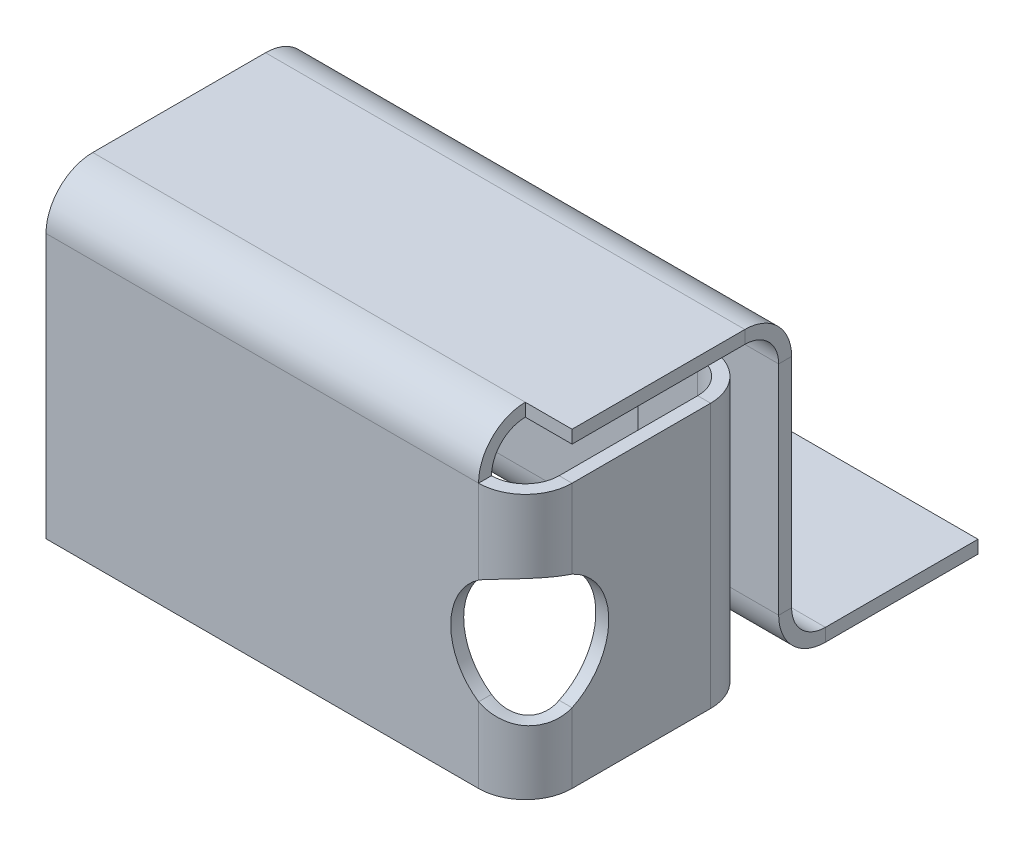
ISO-10303-21;
HEADER;
FILE_DESCRIPTION(('STEP AP214'),'2;1');
FILE_NAME('part.step','',(''),(''),'','','');
FILE_SCHEMA(('AUTOMOTIVE_DESIGN { 1 0 10303 214 1 1 1 1 }'));
ENDSEC;
DATA;
#1=APPLICATION_CONTEXT('core data for automotive mechanical design processes');
#2=APPLICATION_PROTOCOL_DEFINITION('international standard','automotive_design',2000,#1);
#3=PRODUCT_CONTEXT('',#1,'mechanical');
#4=PRODUCT('Part','Part','',(#3));
#5=PRODUCT_RELATED_PRODUCT_CATEGORY('part','',(#4));
#6=PRODUCT_DEFINITION_FORMATION('','',#4);
#7=PRODUCT_DEFINITION_CONTEXT('part definition',#1,'design');
#8=PRODUCT_DEFINITION('design','',#6,#7);
#9=PRODUCT_DEFINITION_SHAPE('','',#8);
#10=(LENGTH_UNIT() NAMED_UNIT(*) SI_UNIT(.MILLI.,.METRE.));
#11=(NAMED_UNIT(*) PLANE_ANGLE_UNIT() SI_UNIT($,.RADIAN.));
#12=(NAMED_UNIT(*) SI_UNIT($,.STERADIAN.) SOLID_ANGLE_UNIT());
#13=UNCERTAINTY_MEASURE_WITH_UNIT(LENGTH_MEASURE(1.E-05),#10,'distance_accuracy_value','');
#14=(GEOMETRIC_REPRESENTATION_CONTEXT(3) GLOBAL_UNCERTAINTY_ASSIGNED_CONTEXT((#13)) GLOBAL_UNIT_ASSIGNED_CONTEXT((#10,
#11,#12)) REPRESENTATION_CONTEXT('',''));
#15=CARTESIAN_POINT('',(0.,0.,0.));
#16=DIRECTION('',(0.,0.,1.));
#17=DIRECTION('',(1.,0.,0.));
#18=AXIS2_PLACEMENT_3D('',#15,#16,#17);
#19=CARTESIAN_POINT('',(0.,0.,38.11088));
#20=DIRECTION('',(0.,0.,1.));
#21=DIRECTION('',(1.,0.,0.));
#22=AXIS2_PLACEMENT_3D('',#19,#20,#21);
#23=PLANE('',#22);
#24=DIRECTION('',(0.,1.,0.));
#25=VECTOR('',#24,1.);
#26=CARTESIAN_POINT('',(40.61088,26.78588,38.11088));
#27=LINE('',#26,#25);
#28=CARTESIAN_POINT('',(40.61088,26.78588,38.11088));
#29=VERTEX_POINT('',#28);
#30=CARTESIAN_POINT('',(40.61088,28.,38.11088));
#31=VERTEX_POINT('',#30);
#32=EDGE_CURVE('E703',#29,#31,#27,.T.);
#33=ORIENTED_EDGE('',*,*,#32,.F.);
#34=DIRECTION('',(-1.,0.,0.));
#35=VECTOR('',#34,1.);
#36=CARTESIAN_POINT('',(45.,26.78588,38.11088));
#37=LINE('',#36,#35);
#38=CARTESIAN_POINT('',(45.,26.78588,38.11088));
#39=VERTEX_POINT('',#38);
#40=EDGE_CURVE('E666',#39,#29,#37,.T.);
#41=ORIENTED_EDGE('',*,*,#40,.F.);
#42=DIRECTION('',(0.,-1.,0.));
#43=VECTOR('',#42,1.);
#44=CARTESIAN_POINT('',(45.,28.,38.11088));
#45=LINE('',#44,#43);
#46=CARTESIAN_POINT('',(45.,28.,38.11088));
#47=VERTEX_POINT('',#46);
#48=EDGE_CURVE('E681',#47,#39,#45,.T.);
#49=ORIENTED_EDGE('',*,*,#48,.F.);
#50=DIRECTION('',(-1.,0.,0.));
#51=VECTOR('',#50,1.);
#52=CARTESIAN_POINT('',(45.,28.,38.11088));
#53=LINE('',#52,#51);
#54=EDGE_CURVE('E634',#47,#31,#53,.T.);
#55=ORIENTED_EDGE('',*,*,#54,.T.);
#56=EDGE_LOOP('',(#33,#41,#49,#55));
#57=FACE_BOUND('',#56,.T.);
#58=ADVANCED_FACE('F90',(#57),#23,.T.);
#59=CARTESIAN_POINT('',(45.,23.61088,38.11088));
#60=DIRECTION('',(-1.,0.,0.));
#61=DIRECTION('',(0.,0.,1.));
#62=AXIS2_PLACEMENT_3D('',#59,#60,#61);
#63=CYLINDRICAL_SURFACE('',#62,3.175);
#64=CARTESIAN_POINT('',(0.,26.78588,38.11088));
#65=VERTEX_POINT('',#64);
#66=EDGE_CURVE('E665',#29,#65,#37,.T.);
#67=ORIENTED_EDGE('',*,*,#66,.F.);
#68=CARTESIAN_POINT('',(40.61088,23.61088,38.11088));
#69=DIRECTION('',(1.,0.,0.));
#70=DIRECTION('',(0.,0.,-1.));
#71=AXIS2_PLACEMENT_3D('',#68,#69,#70);
#72=CIRCLE('',#71,3.175);
#73=CARTESIAN_POINT('',(40.61088,23.61088,41.28588));
#74=VERTEX_POINT('',#73);
#75=EDGE_CURVE('E699',#29,#74,#72,.T.);
#76=ORIENTED_EDGE('',*,*,#75,.T.);
#77=DIRECTION('',(-1.,0.,0.));
#78=VECTOR('',#77,1.);
#79=CARTESIAN_POINT('',(45.,23.61088,41.28588));
#80=LINE('',#79,#78);
#81=CARTESIAN_POINT('',(0.,23.61088,41.28588));
#82=VERTEX_POINT('',#81);
#83=EDGE_CURVE('E669',#74,#82,#80,.T.);
#84=ORIENTED_EDGE('',*,*,#83,.T.);
#85=CARTESIAN_POINT('',(0.,23.61088,38.11088));
#86=DIRECTION('',(1.,0.,0.));
#87=DIRECTION('',(0.,0.,-1.));
#88=AXIS2_PLACEMENT_3D('',#85,#86,#87);
#89=CIRCLE('',#88,3.175);
#90=EDGE_CURVE('E594',#65,#82,#89,.T.);
#91=ORIENTED_EDGE('',*,*,#90,.F.);
#92=EDGE_LOOP('',(#67,#76,#84,#91));
#93=FACE_BOUND('',#92,.T.);
#94=ADVANCED_FACE('F843',(#93),#63,.F.);
#95=CARTESIAN_POINT('',(45.,28.,42.5));
#96=DIRECTION('',(0.,0.,-1.));
#97=DIRECTION('',(0.,1.,0.));
#98=AXIS2_PLACEMENT_3D('',#95,#96,#97);
#99=PLANE('',#98);
#100=DIRECTION('',(0.,1.,0.));
#101=VECTOR('',#100,1.);
#102=CARTESIAN_POINT('',(40.61088,-1.21412000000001,42.5));
#103=LINE('',#102,#101);
#104=CARTESIAN_POINT('',(40.61088,-1.21412000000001,42.5));
#105=VERTEX_POINT('',#104);
#106=CARTESIAN_POINT('',(40.61088,5.8347320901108,42.5));
#107=VERTEX_POINT('',#106);
#108=EDGE_CURVE('E710',#105,#107,#103,.T.);
#109=ORIENTED_EDGE('',*,*,#108,.T.);
#110=CARTESIAN_POINT('',(44.,10.78588,42.5));
#111=DIRECTION('',(0.,0.,1.));
#112=DIRECTION('',(1.,0.,0.));
#113=AXIS2_PLACEMENT_3D('',#110,#111,#112);
#114=CIRCLE('',#113,6.);
#115=CARTESIAN_POINT('',(40.61088,15.7370279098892,42.5));
#116=VERTEX_POINT('',#115);
#117=EDGE_CURVE('E107',#116,#107,#114,.T.);
#118=ORIENTED_EDGE('',*,*,#117,.F.);
#119=DIRECTION('',(0.,1.,0.));
#120=VECTOR('',#119,1.);
#121=CARTESIAN_POINT('',(40.61088,-1.21412000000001,42.5));
#122=LINE('',#121,#120);
#123=CARTESIAN_POINT('',(40.61088,23.61088,42.5));
#124=VERTEX_POINT('',#123);
#125=EDGE_CURVE('E100',#116,#124,#122,.T.);
#126=ORIENTED_EDGE('',*,*,#125,.T.);
#127=DIRECTION('',(-1.,0.,0.));
#128=VECTOR('',#127,1.);
#129=CARTESIAN_POINT('',(45.,23.61088,42.5));
#130=LINE('',#129,#128);
#131=CARTESIAN_POINT('',(0.,23.61088,42.5));
#132=VERTEX_POINT('',#131);
#133=EDGE_CURVE('E583',#124,#132,#130,.T.);
#134=ORIENTED_EDGE('',*,*,#133,.T.);
#135=DIRECTION('',(0.,-1.,0.));
#136=VECTOR('',#135,1.);
#137=CARTESIAN_POINT('',(0.,28.,42.5));
#138=LINE('',#137,#136);
#139=CARTESIAN_POINT('',(0.,-1.21412000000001,42.5));
#140=VERTEX_POINT('',#139);
#141=EDGE_CURVE('E584',#132,#140,#138,.T.);
#142=ORIENTED_EDGE('',*,*,#141,.T.);
#143=DIRECTION('',(-1.,0.,0.));
#144=VECTOR('',#143,1.);
#145=CARTESIAN_POINT('',(45.,-1.21412000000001,42.5));
#146=LINE('',#145,#144);
#147=EDGE_CURVE('E673',#105,#140,#146,.T.);
#148=ORIENTED_EDGE('',*,*,#147,.F.);
#149=EDGE_LOOP('',(#109,#118,#126,#134,#142,#148));
#150=FACE_BOUND('',#149,.T.);
#151=ADVANCED_FACE('F848',(#150),#99,.F.);
#152=CARTESIAN_POINT('',(45.,-1.21412000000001,41.28588));
#153=DIRECTION('',(0.,-1.,0.));
#154=DIRECTION('',(0.,0.,-1.));
#155=AXIS2_PLACEMENT_3D('',#152,#153,#154);
#156=PLANE('',#155);
#157=DIRECTION('',(-1.,0.,0.));
#158=VECTOR('',#157,1.);
#159=CARTESIAN_POINT('',(45.,-1.21412000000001,41.28588));
#160=LINE('',#159,#158);
#161=CARTESIAN_POINT('',(40.61088,-1.21412000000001,41.28588));
#162=VERTEX_POINT('',#161);
#163=CARTESIAN_POINT('',(0.,-1.21412000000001,41.28588));
#164=VERTEX_POINT('',#163);
#165=EDGE_CURVE('E671',#162,#164,#160,.T.);
#166=ORIENTED_EDGE('',*,*,#165,.F.);
#167=DIRECTION('',(0.,0.,1.));
#168=VECTOR('',#167,1.);
#169=CARTESIAN_POINT('',(40.61088,-1.21412000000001,41.28588));
#170=LINE('',#169,#168);
#171=EDGE_CURVE('E706',#162,#105,#170,.T.);
#172=ORIENTED_EDGE('',*,*,#171,.T.);
#173=ORIENTED_EDGE('',*,*,#147,.T.);
#174=DIRECTION('',(0.,0.,1.));
#175=VECTOR('',#174,1.);
#176=CARTESIAN_POINT('',(0.,-1.21412000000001,41.28588));
#177=LINE('',#176,#175);
#178=EDGE_CURVE('E587',#164,#140,#177,.T.);
#179=ORIENTED_EDGE('',*,*,#178,.F.);
#180=EDGE_LOOP('',(#166,#172,#173,#179));
#181=FACE_BOUND('',#180,.T.);
#182=ADVANCED_FACE('F903',(#181),#156,.T.);
#183=CARTESIAN_POINT('',(45.,28.,41.28588));
#184=DIRECTION('',(0.,0.,-1.));
#185=DIRECTION('',(0.,1.,0.));
#186=AXIS2_PLACEMENT_3D('',#183,#184,#185);
#187=PLANE('',#186);
#188=CARTESIAN_POINT('',(44.,10.78588,41.28588));
#189=DIRECTION('',(0.,0.,1.));
#190=DIRECTION('',(1.,0.,0.));
#191=AXIS2_PLACEMENT_3D('',#188,#189,#190);
#192=CIRCLE('',#191,6.);
#193=CARTESIAN_POINT('',(40.61088,15.7370279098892,41.28588));
#194=VERTEX_POINT('',#193);
#195=CARTESIAN_POINT('',(40.61088,5.8347320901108,41.28588));
#196=VERTEX_POINT('',#195);
#197=EDGE_CURVE('E588',#194,#196,#192,.T.);
#198=ORIENTED_EDGE('',*,*,#197,.T.);
#199=DIRECTION('',(0.,1.,0.));
#200=VECTOR('',#199,1.);
#201=CARTESIAN_POINT('',(40.61088,-1.21412000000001,41.28588));
#202=LINE('',#201,#200);
#203=EDGE_CURVE('E705',#162,#196,#202,.T.);
#204=ORIENTED_EDGE('',*,*,#203,.F.);
#205=ORIENTED_EDGE('',*,*,#165,.T.);
#206=DIRECTION('',(0.,-1.,0.));
#207=VECTOR('',#206,1.);
#208=CARTESIAN_POINT('',(0.,28.,41.28588));
#209=LINE('',#208,#207);
#210=EDGE_CURVE('E591',#82,#164,#209,.T.);
#211=ORIENTED_EDGE('',*,*,#210,.F.);
#212=ORIENTED_EDGE('',*,*,#83,.F.);
#213=DIRECTION('',(0.,1.,0.));
#214=VECTOR('',#213,1.);
#215=CARTESIAN_POINT('',(40.61088,-1.21412000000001,41.28588));
#216=LINE('',#215,#214);
#217=EDGE_CURVE('E709',#194,#74,#216,.T.);
#218=ORIENTED_EDGE('',*,*,#217,.F.);
#219=EDGE_LOOP('',(#198,#204,#205,#211,#212,#218));
#220=FACE_BOUND('',#219,.T.);
#221=ADVANCED_FACE('F861',(#220),#187,.T.);
#222=CARTESIAN_POINT('',(45.,0.,14.325));
#223=DIRECTION('',(1.,0.,0.));
#224=DIRECTION('',(0.,0.,-1.));
#225=AXIS2_PLACEMENT_3D('',#222,#223,#224);
#226=PLANE('',#225);
#227=DIRECTION('',(0.,-1.,0.));
#228=VECTOR('',#227,1.);
#229=CARTESIAN_POINT('',(45.,0.,14.325));
#230=LINE('',#229,#228);
#231=CARTESIAN_POINT('',(45.,0.,14.325));
#232=VERTEX_POINT('',#231);
#233=CARTESIAN_POINT('',(45.,-1.21412,14.325));
#234=VERTEX_POINT('',#233);
#235=EDGE_CURVE('E697',#232,#234,#230,.T.);
#236=ORIENTED_EDGE('',*,*,#235,.F.);
#237=CARTESIAN_POINT('',(45.,3.175,14.325));
#238=DIRECTION('',(1.,0.,0.));
#239=DIRECTION('',(0.,0.,-1.));
#240=AXIS2_PLACEMENT_3D('',#237,#238,#239);
#241=CIRCLE('',#240,3.175);
#242=CARTESIAN_POINT('',(45.,3.175,17.5));
#243=VERTEX_POINT('',#242);
#244=EDGE_CURVE('E571',#232,#243,#241,.F.);
#245=ORIENTED_EDGE('',*,*,#244,.T.);
#246=DIRECTION('',(0.,0.,-1.));
#247=VECTOR('',#246,1.);
#248=CARTESIAN_POINT('',(45.,3.175,18.71412));
#249=LINE('',#248,#247);
#250=CARTESIAN_POINT('',(45.,3.175,18.71412));
#251=VERTEX_POINT('',#250);
#252=EDGE_CURVE('E695',#251,#243,#249,.T.);
#253=ORIENTED_EDGE('',*,*,#252,.F.);
#254=CARTESIAN_POINT('',(45.,3.175,14.325));
#255=DIRECTION('',(1.,0.,0.));
#256=DIRECTION('',(0.,0.,-1.));
#257=AXIS2_PLACEMENT_3D('',#254,#255,#256);
#258=CIRCLE('',#257,4.38912);
#259=EDGE_CURVE('E559',#234,#251,#258,.F.);
#260=ORIENTED_EDGE('',*,*,#259,.F.);
#261=EDGE_LOOP('',(#236,#245,#253,#260));
#262=FACE_BOUND('',#261,.T.);
#263=ADVANCED_FACE('F857',(#262),#226,.T.);
#264=CARTESIAN_POINT('',(45.,3.175,18.71412));
#265=DIRECTION('',(1.,0.,0.));
#266=DIRECTION('',(0.,0.,-1.));
#267=AXIS2_PLACEMENT_3D('',#264,#265,#266);
#268=PLANE('',#267);
#269=DIRECTION('',(0.,0.,1.));
#270=VECTOR('',#269,1.);
#271=CARTESIAN_POINT('',(45.,0.,0.));
#272=LINE('',#271,#270);
#273=CARTESIAN_POINT('',(45.,0.,0.));
#274=VERTEX_POINT('',#273);
#275=EDGE_CURVE('E568',#274,#232,#272,.T.);
#276=ORIENTED_EDGE('',*,*,#275,.T.);
#277=ORIENTED_EDGE('',*,*,#235,.T.);
#278=DIRECTION('',(0.,0.,1.));
#279=VECTOR('',#278,1.);
#280=CARTESIAN_POINT('',(45.,-1.21412,0.));
#281=LINE('',#280,#279);
#282=CARTESIAN_POINT('',(45.,-1.21412,0.));
#283=VERTEX_POINT('',#282);
#284=EDGE_CURVE('E562',#283,#234,#281,.T.);
#285=ORIENTED_EDGE('',*,*,#284,.F.);
#286=DIRECTION('',(0.,-1.,0.));
#287=VECTOR('',#286,1.);
#288=CARTESIAN_POINT('',(45.,0.,0.));
#289=LINE('',#288,#287);
#290=EDGE_CURVE('E565',#274,#283,#289,.T.);
#291=ORIENTED_EDGE('',*,*,#290,.F.);
#292=EDGE_LOOP('',(#276,#277,#285,#291));
#293=FACE_BOUND('',#292,.T.);
#294=ADVANCED_FACE('F860',(#293),#268,.T.);
#295=CARTESIAN_POINT('',(0.,3.175,17.5));
#296=DIRECTION('',(-1.,0.,0.));
#297=DIRECTION('',(0.,0.,1.));
#298=AXIS2_PLACEMENT_3D('',#295,#296,#297);
#299=PLANE('',#298);
#300=DIRECTION('',(0.,0.,1.));
#301=VECTOR('',#300,1.);
#302=CARTESIAN_POINT('',(0.,3.175,17.5));
#303=LINE('',#302,#301);
#304=CARTESIAN_POINT('',(0.,3.175,17.5));
#305=VERTEX_POINT('',#304);
#306=CARTESIAN_POINT('',(0.,3.175,18.71412));
#307=VERTEX_POINT('',#306);
#308=EDGE_CURVE('E693',#305,#307,#303,.T.);
#309=ORIENTED_EDGE('',*,*,#308,.F.);
#310=CARTESIAN_POINT('',(0.,3.175,14.325));
#311=DIRECTION('',(1.,0.,0.));
#312=DIRECTION('',(0.,0.,-1.));
#313=AXIS2_PLACEMENT_3D('',#310,#311,#312);
#314=CIRCLE('',#313,3.175);
#315=CARTESIAN_POINT('',(0.,0.,14.325));
#316=VERTEX_POINT('',#315);
#317=EDGE_CURVE('E618',#316,#305,#314,.F.);
#318=ORIENTED_EDGE('',*,*,#317,.F.);
#319=DIRECTION('',(0.,1.,0.));
#320=VECTOR('',#319,1.);
#321=CARTESIAN_POINT('',(0.,-1.21412,14.325));
#322=LINE('',#321,#320);
#323=CARTESIAN_POINT('',(0.,-1.21412,14.325));
#324=VERTEX_POINT('',#323);
#325=EDGE_CURVE('E691',#324,#316,#322,.T.);
#326=ORIENTED_EDGE('',*,*,#325,.F.);
#327=CARTESIAN_POINT('',(0.,3.175,14.325));
#328=DIRECTION('',(1.,0.,0.));
#329=DIRECTION('',(0.,0.,-1.));
#330=AXIS2_PLACEMENT_3D('',#327,#328,#329);
#331=CIRCLE('',#330,4.38912);
#332=EDGE_CURVE('E606',#324,#307,#331,.F.);
#333=ORIENTED_EDGE('',*,*,#332,.T.);
#334=EDGE_LOOP('',(#309,#318,#326,#333));
#335=FACE_BOUND('',#334,.T.);
#336=ADVANCED_FACE('F865',(#335),#299,.T.);
#337=CARTESIAN_POINT('',(0.,-1.21412,14.325));
#338=DIRECTION('',(-1.,0.,0.));
#339=DIRECTION('',(0.,0.,1.));
#340=AXIS2_PLACEMENT_3D('',#337,#338,#339);
#341=PLANE('',#340);
#342=DIRECTION('',(0.,1.,0.));
#343=VECTOR('',#342,1.);
#344=CARTESIAN_POINT('',(0.,0.,17.5));
#345=LINE('',#344,#343);
#346=CARTESIAN_POINT('',(0.,23.61088,17.5));
#347=VERTEX_POINT('',#346);
#348=EDGE_CURVE('E621',#305,#347,#345,.T.);
#349=ORIENTED_EDGE('',*,*,#348,.F.);
#350=ORIENTED_EDGE('',*,*,#308,.T.);
#351=DIRECTION('',(0.,1.,0.));
#352=VECTOR('',#351,1.);
#353=CARTESIAN_POINT('',(0.,0.,18.71412));
#354=LINE('',#353,#352);
#355=CARTESIAN_POINT('',(0.,23.61088,18.71412));
#356=VERTEX_POINT('',#355);
#357=EDGE_CURVE('E603',#307,#356,#354,.T.);
#358=ORIENTED_EDGE('',*,*,#357,.T.);
#359=DIRECTION('',(0.,0.,-1.));
#360=VECTOR('',#359,1.);
#361=CARTESIAN_POINT('',(0.,23.61088,18.71412));
#362=LINE('',#361,#360);
#363=EDGE_CURVE('E683',#356,#347,#362,.T.);
#364=ORIENTED_EDGE('',*,*,#363,.T.);
#365=EDGE_LOOP('',(#349,#350,#358,#364));
#366=FACE_BOUND('',#365,.T.);
#367=ADVANCED_FACE('F869',(#366),#341,.T.);
#368=CARTESIAN_POINT('',(45.,23.61088,17.5));
#369=DIRECTION('',(1.,0.,0.));
#370=DIRECTION('',(0.,0.,-1.));
#371=AXIS2_PLACEMENT_3D('',#368,#369,#370);
#372=PLANE('',#371);
#373=DIRECTION('',(0.,0.,1.));
#374=VECTOR('',#373,1.);
#375=CARTESIAN_POINT('',(45.,23.61088,17.5));
#376=LINE('',#375,#374);
#377=CARTESIAN_POINT('',(45.,23.61088,17.5));
#378=VERTEX_POINT('',#377);
#379=CARTESIAN_POINT('',(45.,23.61088,18.71412));
#380=VERTEX_POINT('',#379);
#381=EDGE_CURVE('E689',#378,#380,#376,.T.);
#382=ORIENTED_EDGE('',*,*,#381,.F.);
#383=CARTESIAN_POINT('',(45.,23.61088,21.88912));
#384=DIRECTION('',(-1.,0.,0.));
#385=DIRECTION('',(0.,0.,1.));
#386=AXIS2_PLACEMENT_3D('',#383,#384,#385);
#387=CIRCLE('',#386,4.38912);
#388=CARTESIAN_POINT('',(45.,28.,21.88912));
#389=VERTEX_POINT('',#388);
#390=EDGE_CURVE('E577',#378,#389,#387,.F.);
#391=ORIENTED_EDGE('',*,*,#390,.T.);
#392=DIRECTION('',(0.,1.,0.));
#393=VECTOR('',#392,1.);
#394=CARTESIAN_POINT('',(45.,26.78588,21.88912));
#395=LINE('',#394,#393);
#396=CARTESIAN_POINT('',(45.,26.78588,21.88912));
#397=VERTEX_POINT('',#396);
#398=EDGE_CURVE('E687',#397,#389,#395,.T.);
#399=ORIENTED_EDGE('',*,*,#398,.F.);
#400=CARTESIAN_POINT('',(45.,23.61088,21.88912));
#401=DIRECTION('',(1.,0.,0.));
#402=DIRECTION('',(0.,0.,-1.));
#403=AXIS2_PLACEMENT_3D('',#400,#401,#402);
#404=CIRCLE('',#403,3.175);
#405=EDGE_CURVE('E552',#380,#397,#404,.T.);
#406=ORIENTED_EDGE('',*,*,#405,.F.);
#407=EDGE_LOOP('',(#382,#391,#399,#406));
#408=FACE_BOUND('',#407,.T.);
#409=ADVANCED_FACE('F873',(#408),#372,.T.);
#410=CARTESIAN_POINT('',(45.,26.78588,21.88912));
#411=DIRECTION('',(1.,0.,0.));
#412=DIRECTION('',(0.,0.,-1.));
#413=AXIS2_PLACEMENT_3D('',#410,#411,#412);
#414=PLANE('',#413);
#415=DIRECTION('',(0.,1.,0.));
#416=VECTOR('',#415,1.);
#417=CARTESIAN_POINT('',(45.,0.,17.5));
#418=LINE('',#417,#416);
#419=EDGE_CURVE('E574',#243,#378,#418,.T.);
#420=ORIENTED_EDGE('',*,*,#419,.T.);
#421=ORIENTED_EDGE('',*,*,#381,.T.);
#422=DIRECTION('',(0.,1.,0.));
#423=VECTOR('',#422,1.);
#424=CARTESIAN_POINT('',(45.,0.,18.71412));
#425=LINE('',#424,#423);
#426=EDGE_CURVE('E556',#251,#380,#425,.T.);
#427=ORIENTED_EDGE('',*,*,#426,.F.);
#428=ORIENTED_EDGE('',*,*,#252,.T.);
#429=EDGE_LOOP('',(#420,#421,#427,#428));
#430=FACE_BOUND('',#429,.T.);
#431=ADVANCED_FACE('F877',(#430),#414,.T.);
#432=CARTESIAN_POINT('',(0.,28.,21.88912));
#433=DIRECTION('',(-1.,0.,0.));
#434=DIRECTION('',(0.,0.,1.));
#435=AXIS2_PLACEMENT_3D('',#432,#433,#434);
#436=PLANE('',#435);
#437=DIRECTION('',(0.,-1.,0.));
#438=VECTOR('',#437,1.);
#439=CARTESIAN_POINT('',(0.,28.,21.88912));
#440=LINE('',#439,#438);
#441=CARTESIAN_POINT('',(0.,28.,21.88912));
#442=VERTEX_POINT('',#441);
#443=CARTESIAN_POINT('',(0.,26.78588,21.88912));
#444=VERTEX_POINT('',#443);
#445=EDGE_CURVE('E685',#442,#444,#440,.T.);
#446=ORIENTED_EDGE('',*,*,#445,.F.);
#447=CARTESIAN_POINT('',(0.,23.61088,21.88912));
#448=DIRECTION('',(-1.,0.,0.));
#449=DIRECTION('',(0.,0.,1.));
#450=AXIS2_PLACEMENT_3D('',#447,#448,#449);
#451=CIRCLE('',#450,4.38912);
#452=EDGE_CURVE('E624',#347,#442,#451,.F.);
#453=ORIENTED_EDGE('',*,*,#452,.F.);
#454=ORIENTED_EDGE('',*,*,#363,.F.);
#455=CARTESIAN_POINT('',(0.,23.61088,21.88912));
#456=DIRECTION('',(1.,0.,0.));
#457=DIRECTION('',(0.,0.,-1.));
#458=AXIS2_PLACEMENT_3D('',#455,#456,#457);
#459=CIRCLE('',#458,3.175);
#460=EDGE_CURVE('E600',#356,#444,#459,.T.);
#461=ORIENTED_EDGE('',*,*,#460,.T.);
#462=EDGE_LOOP('',(#446,#453,#454,#461));
#463=FACE_BOUND('',#462,.T.);
#464=ADVANCED_FACE('F881',(#463),#436,.T.);
#465=CARTESIAN_POINT('',(0.,23.61088,18.71412));
#466=DIRECTION('',(-1.,0.,0.));
#467=DIRECTION('',(0.,0.,1.));
#468=AXIS2_PLACEMENT_3D('',#465,#466,#467);
#469=PLANE('',#468);
#470=DIRECTION('',(0.,0.,1.));
#471=VECTOR('',#470,1.);
#472=CARTESIAN_POINT('',(0.,28.,17.5));
#473=LINE('',#472,#471);
#474=CARTESIAN_POINT('',(0.,28.,38.11088));
#475=VERTEX_POINT('',#474);
#476=EDGE_CURVE('E627',#442,#475,#473,.T.);
#477=ORIENTED_EDGE('',*,*,#476,.F.);
#478=ORIENTED_EDGE('',*,*,#445,.T.);
#479=DIRECTION('',(0.,0.,1.));
#480=VECTOR('',#479,1.);
#481=CARTESIAN_POINT('',(0.,26.78588,17.5));
#482=LINE('',#481,#480);
#483=EDGE_CURVE('E597',#444,#65,#482,.T.);
#484=ORIENTED_EDGE('',*,*,#483,.T.);
#485=DIRECTION('',(0.,1.,0.));
#486=VECTOR('',#485,1.);
#487=CARTESIAN_POINT('',(0.,26.78588,38.11088));
#488=LINE('',#487,#486);
#489=EDGE_CURVE('E675',#65,#475,#488,.T.);
#490=ORIENTED_EDGE('',*,*,#489,.T.);
#491=EDGE_LOOP('',(#477,#478,#484,#490));
#492=FACE_BOUND('',#491,.T.);
#493=ADVANCED_FACE('F885',(#492),#469,.T.);
#494=CARTESIAN_POINT('',(45.,23.61088,41.28588));
#495=DIRECTION('',(1.,0.,0.));
#496=DIRECTION('',(0.,0.,-1.));
#497=AXIS2_PLACEMENT_3D('',#494,#495,#496);
#498=PLANE('',#497);
#499=DIRECTION('',(0.,0.,1.));
#500=VECTOR('',#499,1.);
#501=CARTESIAN_POINT('',(45.,28.,17.5));
#502=LINE('',#501,#500);
#503=EDGE_CURVE('E580',#389,#47,#502,.T.);
#504=ORIENTED_EDGE('',*,*,#503,.T.);
#505=ORIENTED_EDGE('',*,*,#48,.T.);
#506=DIRECTION('',(0.,0.,1.));
#507=VECTOR('',#506,1.);
#508=CARTESIAN_POINT('',(45.,26.78588,17.5));
#509=LINE('',#508,#507);
#510=EDGE_CURVE('E544',#397,#39,#509,.T.);
#511=ORIENTED_EDGE('',*,*,#510,.F.);
#512=ORIENTED_EDGE('',*,*,#398,.T.);
#513=EDGE_LOOP('',(#504,#505,#511,#512));
#514=FACE_BOUND('',#513,.T.);
#515=ADVANCED_FACE('F889',(#514),#498,.T.);
#516=CARTESIAN_POINT('',(0.,23.61088,42.5));
#517=DIRECTION('',(-1.,0.,0.));
#518=DIRECTION('',(0.,0.,1.));
#519=AXIS2_PLACEMENT_3D('',#516,#517,#518);
#520=PLANE('',#519);
#521=DIRECTION('',(0.,0.,-1.));
#522=VECTOR('',#521,1.);
#523=CARTESIAN_POINT('',(0.,23.61088,42.5));
#524=LINE('',#523,#522);
#525=EDGE_CURVE('E678',#132,#82,#524,.T.);
#526=ORIENTED_EDGE('',*,*,#525,.F.);
#527=CARTESIAN_POINT('',(0.,23.61088,38.11088));
#528=DIRECTION('',(-1.,0.,0.));
#529=DIRECTION('',(0.,0.,1.));
#530=AXIS2_PLACEMENT_3D('',#527,#528,#529);
#531=CIRCLE('',#530,4.38912);
#532=EDGE_CURVE('E553',#475,#132,#531,.F.);
#533=ORIENTED_EDGE('',*,*,#532,.F.);
#534=ORIENTED_EDGE('',*,*,#489,.F.);
#535=ORIENTED_EDGE('',*,*,#90,.T.);
#536=EDGE_LOOP('',(#526,#533,#534,#535));
#537=FACE_BOUND('',#536,.T.);
#538=ADVANCED_FACE('F893',(#537),#520,.T.);
#539=CARTESIAN_POINT('',(0.,26.78588,38.11088));
#540=DIRECTION('',(-1.,0.,0.));
#541=DIRECTION('',(0.,0.,1.));
#542=AXIS2_PLACEMENT_3D('',#539,#540,#541);
#543=PLANE('',#542);
#544=ORIENTED_EDGE('',*,*,#141,.F.);
#545=ORIENTED_EDGE('',*,*,#525,.T.);
#546=ORIENTED_EDGE('',*,*,#210,.T.);
#547=ORIENTED_EDGE('',*,*,#178,.T.);
#548=EDGE_LOOP('',(#544,#545,#546,#547));
#549=FACE_BOUND('',#548,.T.);
#550=ADVANCED_FACE('F856',(#549),#543,.T.);
#551=CARTESIAN_POINT('',(40.61088,23.61088,38.11088));
#552=DIRECTION('',(1.,0.,0.));
#553=DIRECTION('',(0.,0.,-1.));
#554=AXIS2_PLACEMENT_3D('',#551,#552,#553);
#555=PLANE('',#554);
#556=ORIENTED_EDGE('',*,*,#75,.F.);
#557=ORIENTED_EDGE('',*,*,#32,.T.);
#558=CARTESIAN_POINT('',(40.61088,23.61088,38.11088));
#559=DIRECTION('',(1.,0.,0.));
#560=DIRECTION('',(0.,0.,-1.));
#561=AXIS2_PLACEMENT_3D('',#558,#559,#560);
#562=CIRCLE('',#561,4.38912);
#563=EDGE_CURVE('E115',#31,#124,#562,.T.);
#564=ORIENTED_EDGE('',*,*,#563,.T.);
#565=DIRECTION('',(0.,0.,1.));
#566=VECTOR('',#565,1.);
#567=CARTESIAN_POINT('',(40.61088,23.61088,41.28588));
#568=LINE('',#567,#566);
#569=EDGE_CURVE('E711',#74,#124,#568,.T.);
#570=ORIENTED_EDGE('',*,*,#569,.F.);
#571=EDGE_LOOP('',(#556,#557,#564,#570));
#572=FACE_BOUND('',#571,.T.);
#573=ADVANCED_FACE('F852',(#572),#555,.T.);
#574=CARTESIAN_POINT('',(45.,26.78588,17.5));
#575=DIRECTION('',(0.,-1.,0.));
#576=DIRECTION('',(0.,0.,-1.));
#577=AXIS2_PLACEMENT_3D('',#574,#575,#576);
#578=PLANE('',#577);
#579=ORIENTED_EDGE('',*,*,#483,.F.);
#580=DIRECTION('',(-1.,0.,0.));
#581=VECTOR('',#580,1.);
#582=CARTESIAN_POINT('',(45.,26.78588,21.88912));
#583=LINE('',#582,#581);
#584=EDGE_CURVE('E662',#397,#444,#583,.T.);
#585=ORIENTED_EDGE('',*,*,#584,.F.);
#586=ORIENTED_EDGE('',*,*,#510,.T.);
#587=ORIENTED_EDGE('',*,*,#40,.T.);
#588=ORIENTED_EDGE('',*,*,#66,.T.);
#589=EDGE_LOOP('',(#579,#585,#586,#587,#588));
#590=FACE_BOUND('',#589,.T.);
#591=ADVANCED_FACE('F855',(#590),#578,.T.);
#592=CARTESIAN_POINT('',(45.,23.61088,21.88912));
#593=DIRECTION('',(-1.,0.,0.));
#594=DIRECTION('',(0.,0.,1.));
#595=AXIS2_PLACEMENT_3D('',#592,#593,#594);
#596=CYLINDRICAL_SURFACE('',#595,3.175);
#597=ORIENTED_EDGE('',*,*,#460,.F.);
#598=DIRECTION('',(-1.,0.,0.));
#599=VECTOR('',#598,1.);
#600=CARTESIAN_POINT('',(45.,23.61088,18.71412));
#601=LINE('',#600,#599);
#602=EDGE_CURVE('E659',#380,#356,#601,.T.);
#603=ORIENTED_EDGE('',*,*,#602,.F.);
#604=ORIENTED_EDGE('',*,*,#405,.T.);
#605=ORIENTED_EDGE('',*,*,#584,.T.);
#606=EDGE_LOOP('',(#597,#603,#604,#605));
#607=FACE_BOUND('',#606,.T.);
#608=ADVANCED_FACE('F912',(#607),#596,.F.);
#609=CARTESIAN_POINT('',(45.,0.,18.71412));
#610=DIRECTION('',(0.,0.,1.));
#611=DIRECTION('',(1.,0.,0.));
#612=AXIS2_PLACEMENT_3D('',#609,#610,#611);
#613=PLANE('',#612);
#614=ORIENTED_EDGE('',*,*,#357,.F.);
#615=DIRECTION('',(-1.,0.,0.));
#616=VECTOR('',#615,1.);
#617=CARTESIAN_POINT('',(45.,3.175,18.71412));
#618=LINE('',#617,#616);
#619=EDGE_CURVE('E656',#251,#307,#618,.T.);
#620=ORIENTED_EDGE('',*,*,#619,.F.);
#621=ORIENTED_EDGE('',*,*,#426,.T.);
#622=ORIENTED_EDGE('',*,*,#602,.T.);
#623=EDGE_LOOP('',(#614,#620,#621,#622));
#624=FACE_BOUND('',#623,.T.);
#625=ADVANCED_FACE('F916',(#624),#613,.T.);
#626=CARTESIAN_POINT('',(45.,3.175,14.325));
#627=DIRECTION('',(-1.,0.,0.));
#628=DIRECTION('',(0.,0.,1.));
#629=AXIS2_PLACEMENT_3D('',#626,#627,#628);
#630=CYLINDRICAL_SURFACE('',#629,4.38912);
#631=ORIENTED_EDGE('',*,*,#332,.F.);
#632=DIRECTION('',(-1.,0.,0.));
#633=VECTOR('',#632,1.);
#634=CARTESIAN_POINT('',(45.,-1.21412,14.325));
#635=LINE('',#634,#633);
#636=EDGE_CURVE('E653',#234,#324,#635,.T.);
#637=ORIENTED_EDGE('',*,*,#636,.F.);
#638=ORIENTED_EDGE('',*,*,#259,.T.);
#639=ORIENTED_EDGE('',*,*,#619,.T.);
#640=EDGE_LOOP('',(#631,#637,#638,#639));
#641=FACE_BOUND('',#640,.T.);
#642=ADVANCED_FACE('F920',(#641),#630,.T.);
#643=CARTESIAN_POINT('',(45.,-1.21412,0.));
#644=DIRECTION('',(0.,-1.,0.));
#645=DIRECTION('',(0.,0.,-1.));
#646=AXIS2_PLACEMENT_3D('',#643,#644,#645);
#647=PLANE('',#646);
#648=DIRECTION('',(0.,0.,1.));
#649=VECTOR('',#648,1.);
#650=CARTESIAN_POINT('',(0.,-1.21412,0.));
#651=LINE('',#650,#649);
#652=CARTESIAN_POINT('',(0.,-1.21412,0.));
#653=VERTEX_POINT('',#652);
#654=EDGE_CURVE('E609',#653,#324,#651,.T.);
#655=ORIENTED_EDGE('',*,*,#654,.F.);
#656=DIRECTION('',(-1.,0.,0.));
#657=VECTOR('',#656,1.);
#658=CARTESIAN_POINT('',(45.,-1.21412,0.));
#659=LINE('',#658,#657);
#660=EDGE_CURVE('E651',#283,#653,#659,.T.);
#661=ORIENTED_EDGE('',*,*,#660,.F.);
#662=ORIENTED_EDGE('',*,*,#284,.T.);
#663=ORIENTED_EDGE('',*,*,#636,.T.);
#664=EDGE_LOOP('',(#655,#661,#662,#663));
#665=FACE_BOUND('',#664,.T.);
#666=ADVANCED_FACE('F924',(#665),#647,.T.);
#667=CARTESIAN_POINT('',(45.,0.,0.));
#668=DIRECTION('',(0.,0.,-1.));
#669=DIRECTION('',(0.,1.,0.));
#670=AXIS2_PLACEMENT_3D('',#667,#668,#669);
#671=PLANE('',#670);
#672=DIRECTION('',(0.,-1.,0.));
#673=VECTOR('',#672,1.);
#674=CARTESIAN_POINT('',(0.,0.,0.));
#675=LINE('',#674,#673);
#676=CARTESIAN_POINT('',(0.,0.,0.));
#677=VERTEX_POINT('',#676);
#678=EDGE_CURVE('E612',#677,#653,#675,.T.);
#679=ORIENTED_EDGE('',*,*,#678,.F.);
#680=DIRECTION('',(-1.,0.,0.));
#681=VECTOR('',#680,1.);
#682=CARTESIAN_POINT('',(45.,0.,0.));
#683=LINE('',#682,#681);
#684=EDGE_CURVE('E649',#274,#677,#683,.T.);
#685=ORIENTED_EDGE('',*,*,#684,.F.);
#686=ORIENTED_EDGE('',*,*,#290,.T.);
#687=ORIENTED_EDGE('',*,*,#660,.T.);
#688=EDGE_LOOP('',(#679,#685,#686,#687));
#689=FACE_BOUND('',#688,.T.);
#690=ADVANCED_FACE('F928',(#689),#671,.T.);
#691=CARTESIAN_POINT('',(45.,0.,0.));
#692=DIRECTION('',(0.,-1.,0.));
#693=DIRECTION('',(0.,0.,-1.));
#694=AXIS2_PLACEMENT_3D('',#691,#692,#693);
#695=PLANE('',#694);
#696=DIRECTION('',(0.,0.,1.));
#697=VECTOR('',#696,1.);
#698=CARTESIAN_POINT('',(0.,0.,0.));
#699=LINE('',#698,#697);
#700=EDGE_CURVE('E615',#677,#316,#699,.T.);
#701=ORIENTED_EDGE('',*,*,#700,.T.);
#702=DIRECTION('',(-1.,0.,0.));
#703=VECTOR('',#702,1.);
#704=CARTESIAN_POINT('',(45.,0.,14.325));
#705=LINE('',#704,#703);
#706=EDGE_CURVE('E646',#232,#316,#705,.T.);
#707=ORIENTED_EDGE('',*,*,#706,.F.);
#708=ORIENTED_EDGE('',*,*,#275,.F.);
#709=ORIENTED_EDGE('',*,*,#684,.T.);
#710=EDGE_LOOP('',(#701,#707,#708,#709));
#711=FACE_BOUND('',#710,.T.);
#712=ADVANCED_FACE('F932',(#711),#695,.F.);
#713=CARTESIAN_POINT('',(45.,3.175,14.325));
#714=DIRECTION('',(-1.,0.,0.));
#715=DIRECTION('',(0.,0.,1.));
#716=AXIS2_PLACEMENT_3D('',#713,#714,#715);
#717=CYLINDRICAL_SURFACE('',#716,3.175);
#718=ORIENTED_EDGE('',*,*,#317,.T.);
#719=DIRECTION('',(-1.,0.,0.));
#720=VECTOR('',#719,1.);
#721=CARTESIAN_POINT('',(45.,3.175,17.5));
#722=LINE('',#721,#720);
#723=EDGE_CURVE('E643',#243,#305,#722,.T.);
#724=ORIENTED_EDGE('',*,*,#723,.F.);
#725=ORIENTED_EDGE('',*,*,#244,.F.);
#726=ORIENTED_EDGE('',*,*,#706,.T.);
#727=EDGE_LOOP('',(#718,#724,#725,#726));
#728=FACE_BOUND('',#727,.T.);
#729=ADVANCED_FACE('F936',(#728),#717,.F.);
#730=CARTESIAN_POINT('',(45.,0.,17.5));
#731=DIRECTION('',(0.,0.,1.));
#732=DIRECTION('',(1.,0.,0.));
#733=AXIS2_PLACEMENT_3D('',#730,#731,#732);
#734=PLANE('',#733);
#735=ORIENTED_EDGE('',*,*,#348,.T.);
#736=DIRECTION('',(-1.,0.,0.));
#737=VECTOR('',#736,1.);
#738=CARTESIAN_POINT('',(45.,23.61088,17.5));
#739=LINE('',#738,#737);
#740=EDGE_CURVE('E640',#378,#347,#739,.T.);
#741=ORIENTED_EDGE('',*,*,#740,.F.);
#742=ORIENTED_EDGE('',*,*,#419,.F.);
#743=ORIENTED_EDGE('',*,*,#723,.T.);
#744=EDGE_LOOP('',(#735,#741,#742,#743));
#745=FACE_BOUND('',#744,.T.);
#746=ADVANCED_FACE('F940',(#745),#734,.F.);
#747=CARTESIAN_POINT('',(45.,23.61088,21.88912));
#748=DIRECTION('',(-1.,0.,0.));
#749=DIRECTION('',(0.,0.,1.));
#750=AXIS2_PLACEMENT_3D('',#747,#748,#749);
#751=CYLINDRICAL_SURFACE('',#750,4.38912);
#752=ORIENTED_EDGE('',*,*,#452,.T.);
#753=DIRECTION('',(-1.,0.,0.));
#754=VECTOR('',#753,1.);
#755=CARTESIAN_POINT('',(45.,28.,21.88912));
#756=LINE('',#755,#754);
#757=EDGE_CURVE('E637',#389,#442,#756,.T.);
#758=ORIENTED_EDGE('',*,*,#757,.F.);
#759=ORIENTED_EDGE('',*,*,#390,.F.);
#760=ORIENTED_EDGE('',*,*,#740,.T.);
#761=EDGE_LOOP('',(#752,#758,#759,#760));
#762=FACE_BOUND('',#761,.T.);
#763=ADVANCED_FACE('F944',(#762),#751,.T.);
#764=CARTESIAN_POINT('',(45.,28.,17.5));
#765=DIRECTION('',(0.,-1.,0.));
#766=DIRECTION('',(0.,0.,-1.));
#767=AXIS2_PLACEMENT_3D('',#764,#765,#766);
#768=PLANE('',#767);
#769=ORIENTED_EDGE('',*,*,#476,.T.);
#770=EDGE_CURVE('E633',#31,#475,#53,.T.);
#771=ORIENTED_EDGE('',*,*,#770,.F.);
#772=ORIENTED_EDGE('',*,*,#54,.F.);
#773=ORIENTED_EDGE('',*,*,#503,.F.);
#774=ORIENTED_EDGE('',*,*,#757,.T.);
#775=EDGE_LOOP('',(#769,#771,#772,#773,#774));
#776=FACE_BOUND('',#775,.T.);
#777=ADVANCED_FACE('F948',(#776),#768,.F.);
#778=CARTESIAN_POINT('',(45.,23.61088,38.11088));
#779=DIRECTION('',(-1.,0.,0.));
#780=DIRECTION('',(0.,0.,1.));
#781=AXIS2_PLACEMENT_3D('',#778,#779,#780);
#782=CYLINDRICAL_SURFACE('',#781,4.38912);
#783=ORIENTED_EDGE('',*,*,#563,.F.);
#784=ORIENTED_EDGE('',*,*,#770,.T.);
#785=ORIENTED_EDGE('',*,*,#532,.T.);
#786=ORIENTED_EDGE('',*,*,#133,.F.);
#787=EDGE_LOOP('',(#783,#784,#785,#786));
#788=FACE_BOUND('',#787,.T.);
#789=ADVANCED_FACE('F951',(#788),#782,.T.);
#790=CARTESIAN_POINT('',(0.,23.61088,38.11088));
#791=DIRECTION('',(1.,0.,0.));
#792=DIRECTION('',(0.,0.,-1.));
#793=AXIS2_PLACEMENT_3D('',#790,#791,#792);
#794=PLANE('',#793);
#795=ORIENTED_EDGE('',*,*,#654,.T.);
#796=ORIENTED_EDGE('',*,*,#325,.T.);
#797=ORIENTED_EDGE('',*,*,#700,.F.);
#798=ORIENTED_EDGE('',*,*,#678,.T.);
#799=EDGE_LOOP('',(#795,#796,#797,#798));
#800=FACE_BOUND('',#799,.T.);
#801=ADVANCED_FACE('F511',(#800),#794,.F.);
#802=CARTESIAN_POINT('',(44.,10.78588,41.28588));
#803=DIRECTION('',(0.,0.,1.));
#804=DIRECTION('',(1.,0.,0.));
#805=AXIS2_PLACEMENT_3D('',#802,#803,#804);
#806=CYLINDRICAL_SURFACE('',#805,6.);
#807=CARTESIAN_POINT('',(40.61088,15.7370279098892,42.5));
#808=CARTESIAN_POINT('',(40.61088,15.7370279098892,41.28588));
#809=B_SPLINE_CURVE_WITH_KNOTS('',1,(#807,#808),.UNSPECIFIED.,.F.,.F.,(2,2),(0.,1.),.UNSPECIFIED.);
#810=EDGE_CURVE('E13',#116,#194,#809,.T.);
#811=ORIENTED_EDGE('',*,*,#810,.F.);
#812=ORIENTED_EDGE('',*,*,#117,.T.);
#813=CARTESIAN_POINT('',(40.61088,5.8347320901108,41.28588));
#814=CARTESIAN_POINT('',(40.61088,5.8347320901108,42.5));
#815=B_SPLINE_CURVE_WITH_KNOTS('',1,(#813,#814),.UNSPECIFIED.,.F.,.F.,(2,2),(0.,1.),.UNSPECIFIED.);
#816=EDGE_CURVE('E540',#196,#107,#815,.T.);
#817=ORIENTED_EDGE('',*,*,#816,.F.);
#818=ORIENTED_EDGE('',*,*,#197,.F.);
#819=EDGE_LOOP('',(#811,#812,#817,#818));
#820=FACE_BOUND('',#819,.T.);
#821=ADVANCED_FACE('F92',(#820),#806,.F.);
#822=CARTESIAN_POINT('',(40.61088,5.8347320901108,42.5));
#823=CARTESIAN_POINT('',(41.2138098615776,5.53270623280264,42.5));
#824=CARTESIAN_POINT('',(41.7976088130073,5.29634698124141,42.3746890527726));
#825=CARTESIAN_POINT('',(42.8460040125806,4.95352740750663,41.9309079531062));
#826=CARTESIAN_POINT('',(43.3101048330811,4.84730613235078,41.6131443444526));
#827=CARTESIAN_POINT('',(43.7872915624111,4.79601517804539,41.1428331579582));
#828=CARTESIAN_POINT('',(43.877676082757,4.78983126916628,41.0451297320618));
#829=CARTESIAN_POINT('',(43.9734880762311,4.78745793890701,40.931786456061));
#830=CARTESIAN_POINT('',(43.9840524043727,4.78725789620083,40.9191451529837));
#831=CARTESIAN_POINT('',(44.0050176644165,4.78698513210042,40.8937696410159));
#832=CARTESIAN_POINT('',(44.0182039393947,4.78688168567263,40.8776267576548));
#833=CARTESIAN_POINT('',(44.0543670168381,4.78680353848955,40.8326901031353));
#834=CARTESIAN_POINT('',(44.0780417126,4.78701339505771,40.8024655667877));
#835=CARTESIAN_POINT('',(44.1477512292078,4.78842882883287,40.7110322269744));
#836=CARTESIAN_POINT('',(44.1924710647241,4.79042027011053,40.6490637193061));
#837=CARTESIAN_POINT('',(44.4071628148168,4.80561657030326,40.3346964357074));
#838=CARTESIAN_POINT('',(44.5502880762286,4.83453871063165,40.0687472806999));
#839=CARTESIAN_POINT('',(44.8914082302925,4.97160043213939,39.2478391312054));
#840=CARTESIAN_POINT('',(45.,5.13016347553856,38.6703008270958));
#841=CARTESIAN_POINT('',(45.,5.3555305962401,38.11088));
#842=CARTESIAN_POINT('',(40.61088,5.8347320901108,41.28588));
#843=CARTESIAN_POINT('',(41.0469738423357,5.53274316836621,41.28588));
#844=CARTESIAN_POINT('',(41.469335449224,5.29634698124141,41.1952326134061));
#845=CARTESIAN_POINT('',(42.2277231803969,4.95352740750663,40.8742104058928));
#846=CARTESIAN_POINT('',(42.5634442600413,4.84730613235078,40.6443466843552));
#847=CARTESIAN_POINT('',(42.9086314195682,4.79601517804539,40.3041331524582));
#848=CARTESIAN_POINT('',(42.9740137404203,4.78983126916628,40.2334564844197));
#849=CARTESIAN_POINT('',(43.0433221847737,4.78745793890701,40.1514662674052));
#850=CARTESIAN_POINT('',(43.050964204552,4.78725789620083,40.1423218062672));
#851=CARTESIAN_POINT('',(43.0661300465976,4.78698513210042,40.1239656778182));
#852=CARTESIAN_POINT('',(43.0756687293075,4.78688168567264,40.1122882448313));
#853=CARTESIAN_POINT('',(43.1018283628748,4.78680353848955,40.0797819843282));
#854=CARTESIAN_POINT('',(43.1189541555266,4.78701339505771,40.0579181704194));
#855=CARTESIAN_POINT('',(43.1693805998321,4.78842882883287,39.9917771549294));
#856=CARTESIAN_POINT('',(43.2017300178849,4.79042027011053,39.9469503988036));
#857=CARTESIAN_POINT('',(43.3570336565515,4.80561657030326,39.7195435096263));
#858=CARTESIAN_POINT('',(43.4605675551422,4.83453871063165,39.5271613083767));
#859=CARTESIAN_POINT('',(43.7073269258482,4.97160043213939,38.9333330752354));
#860=CARTESIAN_POINT('',(43.78588,5.13014901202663,38.5155796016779));
#861=CARTESIAN_POINT('',(43.78588,5.3555305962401,38.11088));
#862=B_SPLINE_SURFACE_WITH_KNOTS('',1,3,((#822,#823,#824,#825,#826,#827,#828,#829,#830,#831,
#832,#833,#834,#835,#836,#837,#838,#839,#840,#841),(#842,#843,#844,#845,#846,#847,#848,#849,
#850,#851,#852,#853,#854,#855,#856,#857,#858,#859,#860,#861)),.UNSPECIFIED.,.F.,.F.,.F.,(2,2),
(4,2,2,2,2,2,2,2,2,4),(0.,1.),(0.,0.25,0.5,0.5625,0.5703125,0.578125,0.59375,0.625,0.75,1.),.UNSPECIFIED.);
#863=CARTESIAN_POINT('',(40.61088,5.8347320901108,42.5));
#864=CARTESIAN_POINT('',(41.2138098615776,5.53270623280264,42.5));
#865=CARTESIAN_POINT('',(41.7976088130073,5.29634698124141,42.3746890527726));
#866=CARTESIAN_POINT('',(42.8460040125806,4.95352740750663,41.9309079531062));
#867=CARTESIAN_POINT('',(43.3101048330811,4.84730613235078,41.6131443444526));
#868=CARTESIAN_POINT('',(43.7872915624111,4.79601517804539,41.1428331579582));
#869=CARTESIAN_POINT('',(43.877676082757,4.78983126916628,41.0451297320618));
#870=CARTESIAN_POINT('',(43.9734880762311,4.78745793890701,40.931786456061));
#871=CARTESIAN_POINT('',(43.9840524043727,4.78725789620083,40.9191451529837));
#872=CARTESIAN_POINT('',(44.0050176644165,4.78698513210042,40.8937696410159));
#873=CARTESIAN_POINT('',(44.0182039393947,4.78688168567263,40.8776267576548));
#874=CARTESIAN_POINT('',(44.0543670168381,4.78680353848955,40.8326901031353));
#875=CARTESIAN_POINT('',(44.0780417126,4.78701339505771,40.8024655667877));
#876=CARTESIAN_POINT('',(44.1477512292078,4.78842882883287,40.7110322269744));
#877=CARTESIAN_POINT('',(44.1924710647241,4.79042027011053,40.6490637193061));
#878=CARTESIAN_POINT('',(44.4071628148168,4.80561657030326,40.3346964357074));
#879=CARTESIAN_POINT('',(44.5502880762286,4.83453871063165,40.0687472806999));
#880=CARTESIAN_POINT('',(44.8914082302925,4.97160043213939,39.2478391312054));
#881=CARTESIAN_POINT('',(45.,5.13016347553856,38.6703008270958));
#882=CARTESIAN_POINT('',(45.,5.3555305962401,38.11088));
#883=B_SPLINE_CURVE_WITH_KNOTS('',3,(#863,#864,#865,#866,#867,#868,#869,#870,#871,#872,#873,
#874,#875,#876,#877,#878,#879,#880,#881,#882),.UNSPECIFIED.,.F.,.F.,(4,2,2,2,2,2,2,2,2,4),(0.,
0.25,0.5,0.5625,0.5703125,0.578125,0.59375,0.625,0.75,1.),.UNSPECIFIED.);
#884=CARTESIAN_POINT('',(45.,5.3555305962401,38.1108799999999));
#885=VERTEX_POINT('',#884);
#886=EDGE_CURVE('E365',#107,#885,#883,.T.);
#887=CARTESIAN_POINT('',(45.,5.3555305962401,38.11088));
#888=CARTESIAN_POINT('',(43.78588,5.3555305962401,38.11088));
#889=B_SPLINE_CURVE_WITH_KNOTS('',1,(#887,#888),.UNSPECIFIED.,.F.,.F.,(2,2),(0.,1.),.UNSPECIFIED.);
#890=CARTESIAN_POINT('',(43.78588,5.3555305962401,38.1108799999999));
#891=VERTEX_POINT('',#890);
#892=EDGE_CURVE('E792',#885,#891,#889,.T.);
#893=CARTESIAN_POINT('',(43.78588,5.3555305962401,38.11088));
#894=CARTESIAN_POINT('',(43.78588,5.13014901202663,38.5155796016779));
#895=CARTESIAN_POINT('',(43.7073269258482,4.97160043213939,38.9333330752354));
#896=CARTESIAN_POINT('',(43.4605675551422,4.83453871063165,39.5271613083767));
#897=CARTESIAN_POINT('',(43.3570336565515,4.80561657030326,39.7195435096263));
#898=CARTESIAN_POINT('',(43.2017300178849,4.79042027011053,39.9469503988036));
#899=CARTESIAN_POINT('',(43.1693805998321,4.78842882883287,39.9917771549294));
#900=CARTESIAN_POINT('',(43.1189541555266,4.78701339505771,40.0579181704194));
#901=CARTESIAN_POINT('',(43.1018283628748,4.78680353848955,40.0797819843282));
#902=CARTESIAN_POINT('',(43.0756687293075,4.78688168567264,40.1122882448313));
#903=CARTESIAN_POINT('',(43.0661300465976,4.78698513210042,40.1239656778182));
#904=CARTESIAN_POINT('',(43.050964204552,4.78725789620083,40.1423218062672));
#905=CARTESIAN_POINT('',(43.0433221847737,4.78745793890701,40.1514662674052));
#906=CARTESIAN_POINT('',(42.9740137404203,4.78983126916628,40.2334564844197));
#907=CARTESIAN_POINT('',(42.9086314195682,4.79601517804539,40.3041331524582));
#908=CARTESIAN_POINT('',(42.5634442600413,4.84730613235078,40.6443466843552));
#909=CARTESIAN_POINT('',(42.2277231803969,4.95352740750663,40.8742104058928));
#910=CARTESIAN_POINT('',(41.469335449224,5.29634698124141,41.1952326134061));
#911=CARTESIAN_POINT('',(41.0469738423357,5.53274316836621,41.28588));
#912=CARTESIAN_POINT('',(40.61088,5.8347320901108,41.28588));
#913=B_SPLINE_CURVE_WITH_KNOTS('',3,(#893,#894,#895,#896,#897,#898,#899,#900,#901,#902,#903,
#904,#905,#906,#907,#908,#909,#910,#911,#912),.UNSPECIFIED.,.F.,.F.,(4,2,2,2,2,2,2,2,2,4),(0.,
0.25,0.375,0.40625,0.421875,0.4296875,0.4375,0.5,0.75,1.),.UNSPECIFIED.);
#914=EDGE_CURVE('E466',#196,#891,#913,.F.);
#915=ORIENTED_EDGE('',*,*,#816,.T.);
#916=ORIENTED_EDGE('',*,*,#886,.T.);
#917=ORIENTED_EDGE('',*,*,#892,.T.);
#918=ORIENTED_EDGE('',*,*,#914,.F.);
#919=EDGE_LOOP('',(#915,#916,#917,#918));
#920=FACE_BOUND('',#919,.T.);
#921=ADVANCED_FACE('F503',(#920),#862,.F.);
#922=CARTESIAN_POINT('',(40.61088,-1.21412000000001,38.11088));
#923=DIRECTION('',(0.,1.,0.));
#924=DIRECTION('',(0.,0.,1.));
#925=AXIS2_PLACEMENT_3D('',#922,#923,#924);
#926=PLANE('',#925);
#927=DIRECTION('',(1.,0.,0.));
#928=VECTOR('',#927,1.);
#929=CARTESIAN_POINT('',(43.78588,-1.21412,38.1108799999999));
#930=LINE('',#929,#928);
#931=CARTESIAN_POINT('',(43.78588,-1.21412,38.11088));
#932=VERTEX_POINT('',#931);
#933=CARTESIAN_POINT('',(45.,-1.21412000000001,38.1108799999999));
#934=VERTEX_POINT('',#933);
#935=EDGE_CURVE('E357',#932,#934,#930,.T.);
#936=ORIENTED_EDGE('',*,*,#935,.T.);
#937=CARTESIAN_POINT('',(40.61088,-1.21412,38.11088));
#938=DIRECTION('',(0.,-1.,0.));
#939=DIRECTION('',(0.,0.,-1.));
#940=AXIS2_PLACEMENT_3D('',#937,#938,#939);
#941=CIRCLE('',#940,4.38912);
#942=EDGE_CURVE('E467',#934,#105,#941,.T.);
#943=ORIENTED_EDGE('',*,*,#942,.T.);
#944=ORIENTED_EDGE('',*,*,#171,.F.);
#945=CARTESIAN_POINT('',(40.61088,-1.21412000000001,38.11088));
#946=DIRECTION('',(0.,-1.,0.));
#947=DIRECTION('',(0.,0.,-1.));
#948=AXIS2_PLACEMENT_3D('',#945,#946,#947);
#949=CIRCLE('',#948,3.175);
#950=EDGE_CURVE('E458',#932,#162,#949,.T.);
#951=ORIENTED_EDGE('',*,*,#950,.F.);
#952=EDGE_LOOP('',(#936,#943,#944,#951));
#953=FACE_BOUND('',#952,.T.);
#954=ADVANCED_FACE('F500',(#953),#926,.F.);
#955=CARTESIAN_POINT('',(40.61088,11.6083732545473,38.11088));
#956=DIRECTION('',(0.,-1.,0.));
#957=DIRECTION('',(0.,0.,-1.));
#958=AXIS2_PLACEMENT_3D('',#955,#956,#957);
#959=CYLINDRICAL_SURFACE('',#958,3.175);
#960=ORIENTED_EDGE('',*,*,#950,.T.);
#961=ORIENTED_EDGE('',*,*,#203,.T.);
#962=ORIENTED_EDGE('',*,*,#914,.T.);
#963=DIRECTION('',(0.,-1.,0.));
#964=VECTOR('',#963,1.);
#965=CARTESIAN_POINT('',(43.78588,23.61088,38.1108799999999));
#966=LINE('',#965,#964);
#967=EDGE_CURVE('E361',#891,#932,#966,.T.);
#968=ORIENTED_EDGE('',*,*,#967,.T.);
#969=EDGE_LOOP('',(#960,#961,#962,#968));
#970=FACE_BOUND('',#969,.T.);
#971=ADVANCED_FACE('F429',(#970),#959,.F.);
#972=CARTESIAN_POINT('',(40.61088,11.6083732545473,38.11088));
#973=DIRECTION('',(0.,-1.,0.));
#974=DIRECTION('',(0.,0.,-1.));
#975=AXIS2_PLACEMENT_3D('',#972,#973,#974);
#976=CYLINDRICAL_SURFACE('',#975,4.38912);
#977=ORIENTED_EDGE('',*,*,#942,.F.);
#978=DIRECTION('',(0.,1.,0.));
#979=VECTOR('',#978,1.);
#980=CARTESIAN_POINT('',(45.,23.61088,38.1108799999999));
#981=LINE('',#980,#979);
#982=EDGE_CURVE('E360',#934,#885,#981,.T.);
#983=ORIENTED_EDGE('',*,*,#982,.T.);
#984=ORIENTED_EDGE('',*,*,#886,.F.);
#985=ORIENTED_EDGE('',*,*,#108,.F.);
#986=EDGE_LOOP('',(#977,#983,#984,#985));
#987=FACE_BOUND('',#986,.T.);
#988=ADVANCED_FACE('F428',(#987),#976,.T.);
#989=CARTESIAN_POINT('',(45.,16.2162294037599,38.11088));
#990=CARTESIAN_POINT('',(45.,16.4339330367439,38.7712152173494));
#991=CARTESIAN_POINT('',(44.8500206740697,16.5872346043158,39.3980725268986));
#992=CARTESIAN_POINT('',(44.346541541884,16.7670219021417,40.4924784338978));
#993=CARTESIAN_POINT('',(43.9942898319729,16.7931762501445,40.9594412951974));
#994=CARTESIAN_POINT('',(43.4943141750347,16.7461950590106,41.4227931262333));
#995=CARTESIAN_POINT('',(43.391311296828,16.7328151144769,41.5095862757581));
#996=CARTESIAN_POINT('',(43.2728949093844,16.7132810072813,41.6006258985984));
#997=CARTESIAN_POINT('',(43.2597022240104,16.7110483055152,41.6106498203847));
#998=CARTESIAN_POINT('',(43.2332490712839,16.7064584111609,41.6305147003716));
#999=CARTESIAN_POINT('',(43.2173542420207,16.7036433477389,41.6423119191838));
#1000=CARTESIAN_POINT('',(43.1723813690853,16.6955201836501,41.6752123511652));
#1001=CARTESIAN_POINT('',(43.1422084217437,16.689864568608,41.6967013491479));
#1002=CARTESIAN_POINT('',(43.0511598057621,16.6721772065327,41.7598339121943));
#1003=CARTESIAN_POINT('',(42.9897545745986,16.6594249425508,41.800142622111));
#1004=CARTESIAN_POINT('',(42.679763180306,16.5908601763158,41.9928065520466));
#1005=CARTESIAN_POINT('',(42.4223609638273,16.5206373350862,42.1184059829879));
#1006=CARTESIAN_POINT('',(41.6418406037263,16.2638557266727,42.4133105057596));
#1007=CARTESIAN_POINT('',(41.1112200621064,16.0309155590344,42.5));
#1008=CARTESIAN_POINT('',(40.61088,15.7370279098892,42.5));
#1009=CARTESIAN_POINT('',(43.78588,16.2162294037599,38.11088));
#1010=CARTESIAN_POINT('',(43.78588,16.4339058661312,38.5884934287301));
#1011=CARTESIAN_POINT('',(43.6773880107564,16.5872346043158,39.0420088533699));
#1012=CARTESIAN_POINT('',(43.3131814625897,16.7670219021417,39.8336797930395));
#1013=CARTESIAN_POINT('',(43.0583697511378,16.7931762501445,40.1714712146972));
#1014=CARTESIAN_POINT('',(42.696697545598,16.7461950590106,40.5066504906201));
#1015=CARTESIAN_POINT('',(42.6221873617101,16.7328151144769,40.5694348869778));
#1016=CARTESIAN_POINT('',(42.5365273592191,16.7132810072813,40.6352910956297));
#1017=CARTESIAN_POINT('',(42.5269840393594,16.7110483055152,40.6425421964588));
#1018=CARTESIAN_POINT('',(42.5078483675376,16.7064584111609,40.6569120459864));
#1019=CARTESIAN_POINT('',(42.4963503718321,16.7036433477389,40.6654459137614));
#1020=CARTESIAN_POINT('',(42.4638179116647,16.6955201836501,40.6892454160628));
#1021=CARTESIAN_POINT('',(42.4419914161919,16.689864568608,40.7047901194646));
#1022=CARTESIAN_POINT('',(42.3761287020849,16.6721772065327,40.7504589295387));
#1023=CARTESIAN_POINT('',(42.3317094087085,16.6594249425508,40.7796174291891));
#1024=CARTESIAN_POINT('',(42.1074679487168,16.5908601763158,40.9189865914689));
#1025=CARTESIAN_POINT('',(41.9212684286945,16.5206373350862,41.0098426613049));
#1026=CARTESIAN_POINT('',(41.3566558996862,16.2638557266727,41.2231705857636));
#1027=CARTESIAN_POINT('',(40.9728784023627,16.0309663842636,41.28588));
#1028=CARTESIAN_POINT('',(40.61088,15.7370279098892,41.28588));
#1029=B_SPLINE_SURFACE_WITH_KNOTS('',1,3,((#989,#990,#991,#992,#993,#994,#995,#996,#997,#998,
#999,#1000,#1001,#1002,#1003,#1004,#1005,#1006,#1007,#1008),(#1009,#1010,#1011,#1012,#1013,
#1014,#1015,#1016,#1017,#1018,#1019,#1020,#1021,#1022,#1023,#1024,#1025,#1026,#1027,#1028)),
.UNSPECIFIED.,.F.,.F.,.F.,(2,2),(4,2,2,2,2,2,2,2,2,4),(0.,1.),(0.,0.25,0.5,0.5625,0.5703125,
0.578125,0.59375,0.625,0.75,1.),.UNSPECIFIED.);
#1030=CARTESIAN_POINT('',(43.78588,16.2162294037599,38.11088));
#1031=CARTESIAN_POINT('',(45.,16.2162294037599,38.11088));
#1032=B_SPLINE_CURVE_WITH_KNOTS('',1,(#1030,#1031),.UNSPECIFIED.,.F.,.F.,(2,2),(0.,1.),.UNSPECIFIED.);
#1033=CARTESIAN_POINT('',(43.78588,16.2162294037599,38.1108799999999));
#1034=VERTEX_POINT('',#1033);
#1035=CARTESIAN_POINT('',(45.,16.2162294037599,38.1108799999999));
#1036=VERTEX_POINT('',#1035);
#1037=EDGE_CURVE('E454',#1034,#1036,#1032,.T.);
#1038=CARTESIAN_POINT('',(45.,16.2162294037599,38.11088));
#1039=CARTESIAN_POINT('',(45.,16.4339330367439,38.7712152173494));
#1040=CARTESIAN_POINT('',(44.8500206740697,16.5872346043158,39.3980725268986));
#1041=CARTESIAN_POINT('',(44.346541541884,16.7670219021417,40.4924784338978));
#1042=CARTESIAN_POINT('',(43.9942898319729,16.7931762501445,40.9594412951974));
#1043=CARTESIAN_POINT('',(43.4943141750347,16.7461950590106,41.4227931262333));
#1044=CARTESIAN_POINT('',(43.391311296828,16.7328151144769,41.5095862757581));
#1045=CARTESIAN_POINT('',(43.2728949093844,16.7132810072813,41.6006258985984));
#1046=CARTESIAN_POINT('',(43.2597022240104,16.7110483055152,41.6106498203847));
#1047=CARTESIAN_POINT('',(43.2332490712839,16.7064584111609,41.6305147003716));
#1048=CARTESIAN_POINT('',(43.2173542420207,16.7036433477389,41.6423119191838));
#1049=CARTESIAN_POINT('',(43.1723813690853,16.6955201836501,41.6752123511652));
#1050=CARTESIAN_POINT('',(43.1422084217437,16.689864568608,41.6967013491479));
#1051=CARTESIAN_POINT('',(43.0511598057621,16.6721772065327,41.7598339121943));
#1052=CARTESIAN_POINT('',(42.9897545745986,16.6594249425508,41.800142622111));
#1053=CARTESIAN_POINT('',(42.679763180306,16.5908601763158,41.9928065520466));
#1054=CARTESIAN_POINT('',(42.4223609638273,16.5206373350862,42.1184059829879));
#1055=CARTESIAN_POINT('',(41.6418406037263,16.2638557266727,42.4133105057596));
#1056=CARTESIAN_POINT('',(41.1112200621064,16.0309155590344,42.5));
#1057=CARTESIAN_POINT('',(40.61088,15.7370279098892,42.5));
#1058=B_SPLINE_CURVE_WITH_KNOTS('',3,(#1038,#1039,#1040,#1041,#1042,#1043,#1044,#1045,#1046,
#1047,#1048,#1049,#1050,#1051,#1052,#1053,#1054,#1055,#1056,#1057),.UNSPECIFIED.,.F.,.F.,(4,2,2,
2,2,2,2,2,2,4),(0.,0.25,0.5,0.5625,0.5703125,0.578125,0.59375,0.625,0.75,1.),.UNSPECIFIED.);
#1059=EDGE_CURVE('E369',#1036,#116,#1058,.T.);
#1060=CARTESIAN_POINT('',(40.61088,15.7370279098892,41.28588));
#1061=CARTESIAN_POINT('',(40.9728784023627,16.0309663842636,41.28588));
#1062=CARTESIAN_POINT('',(41.3566558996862,16.2638557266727,41.2231705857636));
#1063=CARTESIAN_POINT('',(41.9212684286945,16.5206373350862,41.0098426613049));
#1064=CARTESIAN_POINT('',(42.1074679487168,16.5908601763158,40.9189865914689));
#1065=CARTESIAN_POINT('',(42.3317094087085,16.6594249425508,40.7796174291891));
#1066=CARTESIAN_POINT('',(42.3761287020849,16.6721772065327,40.7504589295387));
#1067=CARTESIAN_POINT('',(42.4419914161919,16.689864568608,40.7047901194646));
#1068=CARTESIAN_POINT('',(42.4638179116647,16.6955201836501,40.6892454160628));
#1069=CARTESIAN_POINT('',(42.4963503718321,16.7036433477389,40.6654459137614));
#1070=CARTESIAN_POINT('',(42.5078483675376,16.7064584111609,40.6569120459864));
#1071=CARTESIAN_POINT('',(42.5269840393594,16.7110483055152,40.6425421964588));
#1072=CARTESIAN_POINT('',(42.5365273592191,16.7132810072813,40.6352910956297));
#1073=CARTESIAN_POINT('',(42.6221873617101,16.7328151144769,40.5694348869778));
#1074=CARTESIAN_POINT('',(42.696697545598,16.7461950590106,40.5066504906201));
#1075=CARTESIAN_POINT('',(43.0583697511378,16.7931762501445,40.1714712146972));
#1076=CARTESIAN_POINT('',(43.3131814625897,16.7670219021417,39.8336797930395));
#1077=CARTESIAN_POINT('',(43.6773880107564,16.5872346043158,39.0420088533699));
#1078=CARTESIAN_POINT('',(43.78588,16.4339058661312,38.5884934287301));
#1079=CARTESIAN_POINT('',(43.78588,16.2162294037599,38.11088));
#1080=B_SPLINE_CURVE_WITH_KNOTS('',3,(#1060,#1061,#1062,#1063,#1064,#1065,#1066,#1067,#1068,
#1069,#1070,#1071,#1072,#1073,#1074,#1075,#1076,#1077,#1078,#1079),.UNSPECIFIED.,.F.,.F.,(4,2,2,
2,2,2,2,2,2,4),(0.,0.25,0.375,0.40625,0.421875,0.4296875,0.4375,0.5,0.75,1.),.UNSPECIFIED.);
#1081=EDGE_CURVE('E366',#1034,#194,#1080,.F.);
#1082=ORIENTED_EDGE('',*,*,#1037,.T.);
#1083=ORIENTED_EDGE('',*,*,#1059,.T.);
#1084=ORIENTED_EDGE('',*,*,#810,.T.);
#1085=ORIENTED_EDGE('',*,*,#1081,.F.);
#1086=EDGE_LOOP('',(#1082,#1083,#1084,#1085));
#1087=FACE_BOUND('',#1086,.T.);
#1088=ADVANCED_FACE('F417',(#1087),#1029,.F.);
#1089=CARTESIAN_POINT('',(40.61088,23.61088,38.11088));
#1090=DIRECTION('',(0.,-1.,0.));
#1091=DIRECTION('',(0.,0.,-1.));
#1092=AXIS2_PLACEMENT_3D('',#1089,#1090,#1091);
#1093=PLANE('',#1092);
#1094=ORIENTED_EDGE('',*,*,#569,.T.);
#1095=CARTESIAN_POINT('',(40.61088,23.61088,38.11088));
#1096=DIRECTION('',(0.,-1.,0.));
#1097=DIRECTION('',(0.,0.,-1.));
#1098=AXIS2_PLACEMENT_3D('',#1095,#1096,#1097);
#1099=CIRCLE('',#1098,4.38912);
#1100=CARTESIAN_POINT('',(45.,23.61088,38.1108799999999));
#1101=VERTEX_POINT('',#1100);
#1102=EDGE_CURVE('E367',#124,#1101,#1099,.F.);
#1103=ORIENTED_EDGE('',*,*,#1102,.T.);
#1104=DIRECTION('',(1.,0.,0.));
#1105=VECTOR('',#1104,1.);
#1106=CARTESIAN_POINT('',(45.,23.61088,38.1108799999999));
#1107=LINE('',#1106,#1105);
#1108=CARTESIAN_POINT('',(43.78588,23.61088,38.11088));
#1109=VERTEX_POINT('',#1108);
#1110=EDGE_CURVE('E305',#1109,#1101,#1107,.T.);
#1111=ORIENTED_EDGE('',*,*,#1110,.F.);
#1112=CARTESIAN_POINT('',(40.61088,23.61088,38.11088));
#1113=DIRECTION('',(0.,1.,0.));
#1114=DIRECTION('',(0.,0.,1.));
#1115=AXIS2_PLACEMENT_3D('',#1112,#1113,#1114);
#1116=CIRCLE('',#1115,3.175);
#1117=EDGE_CURVE('E362',#74,#1109,#1116,.T.);
#1118=ORIENTED_EDGE('',*,*,#1117,.F.);
#1119=EDGE_LOOP('',(#1094,#1103,#1111,#1118));
#1120=FACE_BOUND('',#1119,.T.);
#1121=ADVANCED_FACE('F387',(#1120),#1093,.F.);
#1122=CARTESIAN_POINT('',(40.61088,29.6120264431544,38.11088));
#1123=DIRECTION('',(0.,-1.,0.));
#1124=DIRECTION('',(0.,0.,-1.));
#1125=AXIS2_PLACEMENT_3D('',#1122,#1123,#1124);
#1126=CYLINDRICAL_SURFACE('',#1125,3.175);
#1127=ORIENTED_EDGE('',*,*,#1117,.T.);
#1128=DIRECTION('',(0.,-1.,0.));
#1129=VECTOR('',#1128,1.);
#1130=CARTESIAN_POINT('',(43.78588,23.61088,38.1108799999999));
#1131=LINE('',#1130,#1129);
#1132=EDGE_CURVE('E768',#1109,#1034,#1131,.T.);
#1133=ORIENTED_EDGE('',*,*,#1132,.T.);
#1134=ORIENTED_EDGE('',*,*,#1081,.T.);
#1135=ORIENTED_EDGE('',*,*,#217,.T.);
#1136=EDGE_LOOP('',(#1127,#1133,#1134,#1135));
#1137=FACE_BOUND('',#1136,.T.);
#1138=ADVANCED_FACE('F376',(#1137),#1126,.F.);
#1139=CARTESIAN_POINT('',(40.61088,29.6120264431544,38.11088));
#1140=DIRECTION('',(0.,-1.,0.));
#1141=DIRECTION('',(0.,0.,-1.));
#1142=AXIS2_PLACEMENT_3D('',#1139,#1140,#1141);
#1143=CYLINDRICAL_SURFACE('',#1142,4.38912);
#1144=ORIENTED_EDGE('',*,*,#1102,.F.);
#1145=ORIENTED_EDGE('',*,*,#125,.F.);
#1146=ORIENTED_EDGE('',*,*,#1059,.F.);
#1147=DIRECTION('',(0.,1.,0.));
#1148=VECTOR('',#1147,1.);
#1149=CARTESIAN_POINT('',(45.,23.61088,38.1108799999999));
#1150=LINE('',#1149,#1148);
#1151=EDGE_CURVE('E356',#1036,#1101,#1150,.T.);
#1152=ORIENTED_EDGE('',*,*,#1151,.T.);
#1153=EDGE_LOOP('',(#1144,#1145,#1146,#1152));
#1154=FACE_BOUND('',#1153,.T.);
#1155=ADVANCED_FACE('F386',(#1154),#1143,.T.);
#1156=CARTESIAN_POINT('',(35.,-1.21412000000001,20.7141199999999));
#1157=DIRECTION('',(-1.,0.,0.));
#1158=DIRECTION('',(0.,0.,1.));
#1159=AXIS2_PLACEMENT_3D('',#1156,#1157,#1158);
#1160=PLANE('',#1159);
#1161=DIRECTION('',(0.,1.,0.));
#1162=VECTOR('',#1161,1.);
#1163=CARTESIAN_POINT('',(35.,0.,21.9282399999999));
#1164=LINE('',#1163,#1162);
#1165=CARTESIAN_POINT('',(35.,23.61088,21.9282399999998));
#1166=VERTEX_POINT('',#1165);
#1167=CARTESIAN_POINT('',(35.,-1.21412000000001,21.9282399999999));
#1168=VERTEX_POINT('',#1167);
#1169=EDGE_CURVE('E335',#1166,#1168,#1164,.F.);
#1170=ORIENTED_EDGE('',*,*,#1169,.F.);
#1171=DIRECTION('',(0.,0.,1.));
#1172=VECTOR('',#1171,1.);
#1173=CARTESIAN_POINT('',(35.,23.61088,20.7141199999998));
#1174=LINE('',#1173,#1172);
#1175=CARTESIAN_POINT('',(35.,23.61088,20.7141199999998));
#1176=VERTEX_POINT('',#1175);
#1177=EDGE_CURVE('E340',#1176,#1166,#1174,.T.);
#1178=ORIENTED_EDGE('',*,*,#1177,.F.);
#1179=DIRECTION('',(0.,-1.,0.));
#1180=VECTOR('',#1179,1.);
#1181=CARTESIAN_POINT('',(35.,-1.21412000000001,20.7141199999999));
#1182=LINE('',#1181,#1180);
#1183=CARTESIAN_POINT('',(35.,-1.21412000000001,20.7141199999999));
#1184=VERTEX_POINT('',#1183);
#1185=EDGE_CURVE('E353',#1176,#1184,#1182,.T.);
#1186=ORIENTED_EDGE('',*,*,#1185,.T.);
#1187=DIRECTION('',(0.,0.,1.));
#1188=VECTOR('',#1187,1.);
#1189=CARTESIAN_POINT('',(35.,-1.21412000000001,20.7141199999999));
#1190=LINE('',#1189,#1188);
#1191=EDGE_CURVE('E351',#1184,#1168,#1190,.T.);
#1192=ORIENTED_EDGE('',*,*,#1191,.T.);
#1193=EDGE_LOOP('',(#1170,#1178,#1186,#1192));
#1194=FACE_BOUND('',#1193,.T.);
#1195=ADVANCED_FACE('F394',(#1194),#1160,.T.);
#1196=CARTESIAN_POINT('',(43.78588,-1.21412000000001,20.7141199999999));
#1197=DIRECTION('',(0.,-1.,0.));
#1198=DIRECTION('',(0.,0.,-1.));
#1199=AXIS2_PLACEMENT_3D('',#1196,#1197,#1198);
#1200=PLANE('',#1199);
#1201=DIRECTION('',(1.,0.,0.));
#1202=VECTOR('',#1201,1.);
#1203=CARTESIAN_POINT('',(43.78588,-1.21412000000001,20.7141199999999));
#1204=LINE('',#1203,#1202);
#1205=CARTESIAN_POINT('',(40.61088,-1.21412000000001,20.7141199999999));
#1206=VERTEX_POINT('',#1205);
#1207=EDGE_CURVE('E348',#1184,#1206,#1204,.T.);
#1208=ORIENTED_EDGE('',*,*,#1207,.T.);
#1209=DIRECTION('',(0.,0.,-1.));
#1210=VECTOR('',#1209,1.);
#1211=CARTESIAN_POINT('',(40.61088,-1.21412000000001,21.9282399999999));
#1212=LINE('',#1211,#1210);
#1213=CARTESIAN_POINT('',(40.61088,-1.21412000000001,21.9282399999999));
#1214=VERTEX_POINT('',#1213);
#1215=EDGE_CURVE('E329',#1214,#1206,#1212,.T.);
#1216=ORIENTED_EDGE('',*,*,#1215,.F.);
#1217=DIRECTION('',(-1.,0.,0.));
#1218=VECTOR('',#1217,1.);
#1219=CARTESIAN_POINT('',(-1.89518539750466E-13,-1.21411999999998,21.9282399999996));
#1220=LINE('',#1219,#1218);
#1221=EDGE_CURVE('E332',#1168,#1214,#1220,.F.);
#1222=ORIENTED_EDGE('',*,*,#1221,.F.);
#1223=ORIENTED_EDGE('',*,*,#1191,.F.);
#1224=EDGE_LOOP('',(#1208,#1216,#1222,#1223));
#1225=FACE_BOUND('',#1224,.T.);
#1226=ADVANCED_FACE('F827',(#1225),#1200,.T.);
#1227=CARTESIAN_POINT('',(-1.80844922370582E-13,0.,20.7141199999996));
#1228=DIRECTION('',(0.,0.,-1.));
#1229=DIRECTION('',(-1.,0.,0.));
#1230=AXIS2_PLACEMENT_3D('',#1227,#1228,#1229);
#1231=PLANE('',#1230);
#1232=DIRECTION('',(-1.,0.,0.));
#1233=VECTOR('',#1232,1.);
#1234=CARTESIAN_POINT('',(35.,23.61088,20.7141199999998));
#1235=LINE('',#1234,#1233);
#1236=CARTESIAN_POINT('',(40.6108800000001,23.61088,20.7141199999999));
#1237=VERTEX_POINT('',#1236);
#1238=EDGE_CURVE('E343',#1237,#1176,#1235,.T.);
#1239=ORIENTED_EDGE('',*,*,#1238,.F.);
#1240=DIRECTION('',(0.,-1.,0.));
#1241=VECTOR('',#1240,1.);
#1242=CARTESIAN_POINT('',(40.61088,0.,20.7141199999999));
#1243=LINE('',#1242,#1241);
#1244=EDGE_CURVE('E321',#1237,#1206,#1243,.T.);
#1245=ORIENTED_EDGE('',*,*,#1244,.T.);
#1246=ORIENTED_EDGE('',*,*,#1207,.F.);
#1247=ORIENTED_EDGE('',*,*,#1185,.F.);
#1248=EDGE_LOOP('',(#1239,#1245,#1246,#1247));
#1249=FACE_BOUND('',#1248,.T.);
#1250=ADVANCED_FACE('F833',(#1249),#1231,.T.);
#1251=CARTESIAN_POINT('',(35.,23.61088,20.7141199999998));
#1252=DIRECTION('',(0.,1.,0.));
#1253=DIRECTION('',(0.,0.,1.));
#1254=AXIS2_PLACEMENT_3D('',#1251,#1252,#1253);
#1255=PLANE('',#1254);
#1256=DIRECTION('',(1.,0.,0.));
#1257=VECTOR('',#1256,1.);
#1258=CARTESIAN_POINT('',(-1.68701858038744E-13,23.61088,21.9282399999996));
#1259=LINE('',#1258,#1257);
#1260=CARTESIAN_POINT('',(40.6108800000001,23.61088,21.9282399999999));
#1261=VERTEX_POINT('',#1260);
#1262=EDGE_CURVE('E338',#1261,#1166,#1259,.F.);
#1263=ORIENTED_EDGE('',*,*,#1262,.F.);
#1264=DIRECTION('',(0.,0.,-1.));
#1265=VECTOR('',#1264,1.);
#1266=CARTESIAN_POINT('',(40.6108800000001,23.61088,20.7141199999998));
#1267=LINE('',#1266,#1265);
#1268=EDGE_CURVE('E345',#1261,#1237,#1267,.T.);
#1269=ORIENTED_EDGE('',*,*,#1268,.T.);
#1270=ORIENTED_EDGE('',*,*,#1238,.T.);
#1271=ORIENTED_EDGE('',*,*,#1177,.T.);
#1272=EDGE_LOOP('',(#1263,#1269,#1270,#1271));
#1273=FACE_BOUND('',#1272,.T.);
#1274=ADVANCED_FACE('F820',(#1273),#1255,.T.);
#1275=CARTESIAN_POINT('',(-1.89084858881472E-13,0.,21.9282399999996));
#1276=DIRECTION('',(0.,0.,-1.));
#1277=DIRECTION('',(-1.,0.,0.));
#1278=AXIS2_PLACEMENT_3D('',#1275,#1276,#1277);
#1279=PLANE('',#1278);
#1280=DIRECTION('',(0.,1.,0.));
#1281=VECTOR('',#1280,1.);
#1282=CARTESIAN_POINT('',(40.6108800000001,23.61088,21.9282399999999));
#1283=LINE('',#1282,#1281);
#1284=EDGE_CURVE('E809',#1261,#1214,#1283,.F.);
#1285=ORIENTED_EDGE('',*,*,#1284,.F.);
#1286=ORIENTED_EDGE('',*,*,#1262,.T.);
#1287=ORIENTED_EDGE('',*,*,#1169,.T.);
#1288=ORIENTED_EDGE('',*,*,#1221,.T.);
#1289=EDGE_LOOP('',(#1285,#1286,#1287,#1288));
#1290=FACE_BOUND('',#1289,.T.);
#1291=ADVANCED_FACE('F816',(#1290),#1279,.F.);
#1292=CARTESIAN_POINT('',(40.61088,-1.21412000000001,25.1032399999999));
#1293=DIRECTION('',(0.,1.,0.));
#1294=DIRECTION('',(0.,0.,1.));
#1295=AXIS2_PLACEMENT_3D('',#1292,#1293,#1294);
#1296=PLANE('',#1295);
#1297=CARTESIAN_POINT('',(40.61088,-1.21412000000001,25.1032399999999));
#1298=DIRECTION('',(0.,-1.,0.));
#1299=DIRECTION('',(0.,0.,-1.));
#1300=AXIS2_PLACEMENT_3D('',#1297,#1298,#1299);
#1301=CIRCLE('',#1300,3.175);
#1302=CARTESIAN_POINT('',(43.78588,-1.21412000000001,25.1032399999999));
#1303=VERTEX_POINT('',#1302);
#1304=EDGE_CURVE('E806',#1214,#1303,#1301,.T.);
#1305=ORIENTED_EDGE('',*,*,#1304,.F.);
#1306=ORIENTED_EDGE('',*,*,#1215,.T.);
#1307=CARTESIAN_POINT('',(40.61088,-1.21412000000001,25.1032399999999));
#1308=DIRECTION('',(0.,-1.,0.));
#1309=DIRECTION('',(0.,0.,-1.));
#1310=AXIS2_PLACEMENT_3D('',#1307,#1308,#1309);
#1311=CIRCLE('',#1310,4.38912);
#1312=CARTESIAN_POINT('',(45.,-1.21412000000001,25.1032399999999));
#1313=VERTEX_POINT('',#1312);
#1314=EDGE_CURVE('E317',#1206,#1313,#1311,.T.);
#1315=ORIENTED_EDGE('',*,*,#1314,.T.);
#1316=DIRECTION('',(1.,0.,0.));
#1317=VECTOR('',#1316,1.);
#1318=CARTESIAN_POINT('',(43.78588,-1.21412000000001,25.1032399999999));
#1319=LINE('',#1318,#1317);
#1320=EDGE_CURVE('E307',#1303,#1313,#1319,.T.);
#1321=ORIENTED_EDGE('',*,*,#1320,.F.);
#1322=EDGE_LOOP('',(#1305,#1306,#1315,#1321));
#1323=FACE_BOUND('',#1322,.T.);
#1324=ADVANCED_FACE('F830',(#1323),#1296,.F.);
#1325=CARTESIAN_POINT('',(40.61088,-1.21412000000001,25.1032399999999));
#1326=DIRECTION('',(0.,-1.,0.));
#1327=DIRECTION('',(0.,0.,-1.));
#1328=AXIS2_PLACEMENT_3D('',#1325,#1326,#1327);
#1329=CYLINDRICAL_SURFACE('',#1328,4.38912);
#1330=DIRECTION('',(0.,-1.,0.));
#1331=VECTOR('',#1330,1.);
#1332=CARTESIAN_POINT('',(45.,-1.21412000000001,25.1032399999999));
#1333=LINE('',#1332,#1331);
#1334=CARTESIAN_POINT('',(45.,23.61088,25.1032399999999));
#1335=VERTEX_POINT('',#1334);
#1336=EDGE_CURVE('E285',#1313,#1335,#1333,.F.);
#1337=ORIENTED_EDGE('',*,*,#1336,.F.);
#1338=ORIENTED_EDGE('',*,*,#1314,.F.);
#1339=ORIENTED_EDGE('',*,*,#1244,.F.);
#1340=CARTESIAN_POINT('',(40.61088,23.61088,25.1032399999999));
#1341=DIRECTION('',(0.,-1.,0.));
#1342=DIRECTION('',(0.,0.,-1.));
#1343=AXIS2_PLACEMENT_3D('',#1340,#1341,#1342);
#1344=CIRCLE('',#1343,4.38912);
#1345=EDGE_CURVE('E313',#1335,#1237,#1344,.F.);
#1346=ORIENTED_EDGE('',*,*,#1345,.F.);
#1347=EDGE_LOOP('',(#1337,#1338,#1339,#1346));
#1348=FACE_BOUND('',#1347,.T.);
#1349=ADVANCED_FACE('F319',(#1348),#1329,.T.);
#1350=CARTESIAN_POINT('',(40.61088,23.61088,25.1032399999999));
#1351=DIRECTION('',(0.,1.,0.));
#1352=DIRECTION('',(0.,0.,1.));
#1353=AXIS2_PLACEMENT_3D('',#1350,#1351,#1352);
#1354=PLANE('',#1353);
#1355=ORIENTED_EDGE('',*,*,#1268,.F.);
#1356=CARTESIAN_POINT('',(40.61088,23.61088,25.1032399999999));
#1357=DIRECTION('',(0.,-1.,0.));
#1358=DIRECTION('',(0.,0.,-1.));
#1359=AXIS2_PLACEMENT_3D('',#1356,#1357,#1358);
#1360=CIRCLE('',#1359,3.175);
#1361=CARTESIAN_POINT('',(43.78588,23.61088,25.1032399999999));
#1362=VERTEX_POINT('',#1361);
#1363=EDGE_CURVE('E316',#1362,#1261,#1360,.F.);
#1364=ORIENTED_EDGE('',*,*,#1363,.F.);
#1365=DIRECTION('',(1.,0.,0.));
#1366=VECTOR('',#1365,1.);
#1367=CARTESIAN_POINT('',(43.78588,23.61088,25.1032399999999));
#1368=LINE('',#1367,#1366);
#1369=EDGE_CURVE('E302',#1362,#1335,#1368,.T.);
#1370=ORIENTED_EDGE('',*,*,#1369,.T.);
#1371=ORIENTED_EDGE('',*,*,#1345,.T.);
#1372=EDGE_LOOP('',(#1355,#1364,#1370,#1371));
#1373=FACE_BOUND('',#1372,.T.);
#1374=ADVANCED_FACE('F312',(#1373),#1354,.T.);
#1375=CARTESIAN_POINT('',(40.61088,-1.21412000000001,25.1032399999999));
#1376=DIRECTION('',(0.,-1.,0.));
#1377=DIRECTION('',(0.,0.,-1.));
#1378=AXIS2_PLACEMENT_3D('',#1375,#1376,#1377);
#1379=CYLINDRICAL_SURFACE('',#1378,3.175);
#1380=DIRECTION('',(0.,-1.,0.));
#1381=VECTOR('',#1380,1.);
#1382=CARTESIAN_POINT('',(43.78588,-1.21412000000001,25.1032399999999));
#1383=LINE('',#1382,#1381);
#1384=EDGE_CURVE('E322',#1303,#1362,#1383,.F.);
#1385=ORIENTED_EDGE('',*,*,#1384,.T.);
#1386=ORIENTED_EDGE('',*,*,#1363,.T.);
#1387=ORIENTED_EDGE('',*,*,#1284,.T.);
#1388=ORIENTED_EDGE('',*,*,#1304,.T.);
#1389=EDGE_LOOP('',(#1385,#1386,#1387,#1388));
#1390=FACE_BOUND('',#1389,.T.);
#1391=ADVANCED_FACE('F812',(#1390),#1379,.F.);
#1392=CARTESIAN_POINT('',(43.7858800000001,0.,0.));
#1393=DIRECTION('',(-1.,0.,0.));
#1394=DIRECTION('',(0.,0.,1.));
#1395=AXIS2_PLACEMENT_3D('',#1392,#1393,#1394);
#1396=PLANE('',#1395);
#1397=CARTESIAN_POINT('',(43.78588,10.78588,40.6626059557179));
#1398=DIRECTION('',(1.,0.,0.));
#1399=DIRECTION('',(0.,0.,-1.));
#1400=AXIS2_PLACEMENT_3D('',#1397,#1398,#1399);
#1401=CIRCLE('',#1400,6.);
#1402=EDGE_CURVE('E799',#891,#1034,#1401,.T.);
#1403=ORIENTED_EDGE('',*,*,#1402,.T.);
#1404=ORIENTED_EDGE('',*,*,#1132,.F.);
#1405=DIRECTION('',(0.,0.,-1.));
#1406=VECTOR('',#1405,1.);
#1407=CARTESIAN_POINT('',(43.78588,23.61088,41.2858799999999));
#1408=LINE('',#1407,#1406);
#1409=EDGE_CURVE('E797',#1362,#1109,#1408,.F.);
#1410=ORIENTED_EDGE('',*,*,#1409,.F.);
#1411=ORIENTED_EDGE('',*,*,#1384,.F.);
#1412=DIRECTION('',(0.,0.,1.));
#1413=VECTOR('',#1412,1.);
#1414=CARTESIAN_POINT('',(43.78588,-1.21412000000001,20.7141199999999));
#1415=LINE('',#1414,#1413);
#1416=EDGE_CURVE('E983',#932,#1303,#1415,.F.);
#1417=ORIENTED_EDGE('',*,*,#1416,.F.);
#1418=ORIENTED_EDGE('',*,*,#967,.F.);
#1419=EDGE_LOOP('',(#1403,#1404,#1410,#1411,#1417,#1418));
#1420=FACE_BOUND('',#1419,.T.);
#1421=ADVANCED_FACE('F796',(#1420),#1396,.T.);
#1422=CARTESIAN_POINT('',(45.,23.61088,41.2858799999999));
#1423=DIRECTION('',(0.,-1.,0.));
#1424=DIRECTION('',(0.,0.,-1.));
#1425=AXIS2_PLACEMENT_3D('',#1422,#1423,#1424);
#1426=PLANE('',#1425);
#1427=ORIENTED_EDGE('',*,*,#1369,.F.);
#1428=ORIENTED_EDGE('',*,*,#1409,.T.);
#1429=ORIENTED_EDGE('',*,*,#1110,.T.);
#1430=DIRECTION('',(0.,0.,1.));
#1431=VECTOR('',#1430,1.);
#1432=CARTESIAN_POINT('',(45.0000000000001,23.61088,0.));
#1433=LINE('',#1432,#1431);
#1434=EDGE_CURVE('E289',#1335,#1101,#1433,.T.);
#1435=ORIENTED_EDGE('',*,*,#1434,.F.);
#1436=EDGE_LOOP('',(#1427,#1428,#1429,#1435));
#1437=FACE_BOUND('',#1436,.T.);
#1438=ADVANCED_FACE('F300',(#1437),#1426,.F.);
#1439=CARTESIAN_POINT('',(45.0000000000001,0.,0.));
#1440=DIRECTION('',(-1.,0.,0.));
#1441=DIRECTION('',(0.,0.,1.));
#1442=AXIS2_PLACEMENT_3D('',#1439,#1440,#1441);
#1443=PLANE('',#1442);
#1444=ORIENTED_EDGE('',*,*,#1151,.F.);
#1445=CARTESIAN_POINT('',(45.,10.78588,40.6626059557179));
#1446=DIRECTION('',(-1.,0.,0.));
#1447=DIRECTION('',(0.,0.,1.));
#1448=AXIS2_PLACEMENT_3D('',#1445,#1446,#1447);
#1449=CIRCLE('',#1448,6.);
#1450=EDGE_CURVE('E755',#1036,#885,#1449,.T.);
#1451=ORIENTED_EDGE('',*,*,#1450,.T.);
#1452=ORIENTED_EDGE('',*,*,#982,.F.);
#1453=DIRECTION('',(0.,0.,-1.));
#1454=VECTOR('',#1453,1.);
#1455=CARTESIAN_POINT('',(45.0000000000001,-1.21412000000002,0.));
#1456=LINE('',#1455,#1454);
#1457=EDGE_CURVE('E292',#934,#1313,#1456,.T.);
#1458=ORIENTED_EDGE('',*,*,#1457,.T.);
#1459=ORIENTED_EDGE('',*,*,#1336,.T.);
#1460=ORIENTED_EDGE('',*,*,#1434,.T.);
#1461=EDGE_LOOP('',(#1444,#1451,#1452,#1458,#1459,#1460));
#1462=FACE_BOUND('',#1461,.T.);
#1463=ADVANCED_FACE('F288',(#1462),#1443,.F.);
#1464=CARTESIAN_POINT('',(43.78588,10.78588,40.6626059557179));
#1465=DIRECTION('',(1.,0.,0.));
#1466=DIRECTION('',(0.,0.,-1.));
#1467=AXIS2_PLACEMENT_3D('',#1464,#1465,#1466);
#1468=CYLINDRICAL_SURFACE('',#1467,6.);
#1469=ORIENTED_EDGE('',*,*,#1037,.F.);
#1470=ORIENTED_EDGE('',*,*,#1402,.F.);
#1471=ORIENTED_EDGE('',*,*,#892,.F.);
#1472=ORIENTED_EDGE('',*,*,#1450,.F.);
#1473=EDGE_LOOP('',(#1469,#1470,#1471,#1472));
#1474=FACE_BOUND('',#1473,.T.);
#1475=ADVANCED_FACE('F770',(#1474),#1468,.F.);
#1476=CARTESIAN_POINT('',(45.,-1.21412000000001,20.7141199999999));
#1477=DIRECTION('',(0.,1.,0.));
#1478=DIRECTION('',(0.,0.,1.));
#1479=AXIS2_PLACEMENT_3D('',#1476,#1477,#1478);
#1480=PLANE('',#1479);
#1481=ORIENTED_EDGE('',*,*,#1320,.T.);
#1482=ORIENTED_EDGE('',*,*,#1457,.F.);
#1483=ORIENTED_EDGE('',*,*,#935,.F.);
#1484=ORIENTED_EDGE('',*,*,#1416,.T.);
#1485=EDGE_LOOP('',(#1481,#1482,#1483,#1484));
#1486=FACE_BOUND('',#1485,.T.);
#1487=ADVANCED_FACE('F389',(#1486),#1480,.F.);
#1488=CLOSED_SHELL('',(#58,#94,#151,#182,#221,#263,#294,#336,#367,#409,#431,#464,#493,#515,#538,
#550,#573,#591,#608,#625,#642,#666,#690,#712,#729,#746,#763,#777,#789,#801,#821,#921,#954,#971,
#988,#1088,#1121,#1138,#1155,#1195,#1226,#1250,#1274,#1291,#1324,#1349,#1374,#1391,#1421,#1438,
#1463,#1475,#1487));
#1489=MANIFOLD_SOLID_BREP('B2',#1488);
#1490=ADVANCED_BREP_SHAPE_REPRESENTATION('',(#18,#1489),#14);
#1491=SHAPE_DEFINITION_REPRESENTATION(#9,#1490);
ENDSEC;
END-ISO-10303-21;
